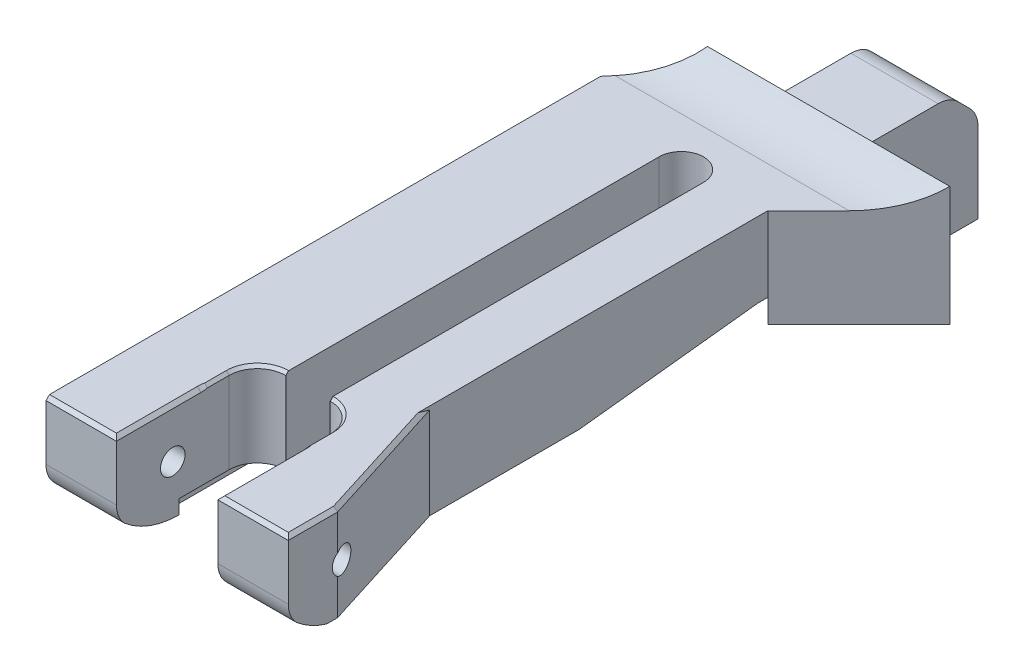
ISO-10303-21;
HEADER;
FILE_DESCRIPTION(('STEP AP214'),'2;1');
FILE_NAME('part.step','',(''),(''),'','','');
FILE_SCHEMA(('AUTOMOTIVE_DESIGN { 1 0 10303 214 1 1 1 1 }'));
ENDSEC;
DATA;
#1=APPLICATION_CONTEXT('core data for automotive mechanical design processes');
#2=APPLICATION_PROTOCOL_DEFINITION('international standard','automotive_design',2000,#1);
#3=PRODUCT_CONTEXT('',#1,'mechanical');
#4=PRODUCT('Part','Part','',(#3));
#5=PRODUCT_RELATED_PRODUCT_CATEGORY('part','',(#4));
#6=PRODUCT_DEFINITION_FORMATION('','',#4);
#7=PRODUCT_DEFINITION_CONTEXT('part definition',#1,'design');
#8=PRODUCT_DEFINITION('design','',#6,#7);
#9=PRODUCT_DEFINITION_SHAPE('','',#8);
#10=(LENGTH_UNIT() NAMED_UNIT(*) SI_UNIT(.MILLI.,.METRE.));
#11=(NAMED_UNIT(*) PLANE_ANGLE_UNIT() SI_UNIT($,.RADIAN.));
#12=(NAMED_UNIT(*) SI_UNIT($,.STERADIAN.) SOLID_ANGLE_UNIT());
#13=UNCERTAINTY_MEASURE_WITH_UNIT(LENGTH_MEASURE(1.E-05),#10,'distance_accuracy_value','');
#14=(GEOMETRIC_REPRESENTATION_CONTEXT(3) GLOBAL_UNCERTAINTY_ASSIGNED_CONTEXT((#13)) GLOBAL_UNIT_ASSIGNED_CONTEXT((#10,
#11,#12)) REPRESENTATION_CONTEXT('',''));
#15=CARTESIAN_POINT('',(0.,0.,0.));
#16=DIRECTION('',(0.,0.,1.));
#17=DIRECTION('',(1.,0.,0.));
#18=AXIS2_PLACEMENT_3D('',#15,#16,#17);
#19=CARTESIAN_POINT('',(-4.3,0.998405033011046,16.));
#20=DIRECTION('',(0.,-1.,0.));
#21=DIRECTION('',(0.,0.,-1.));
#22=AXIS2_PLACEMENT_3D('',#19,#20,#21);
#23=PLANE('',#22);
#24=DIRECTION('',(1.,0.,0.));
#25=VECTOR('',#24,1.);
#26=CARTESIAN_POINT('',(-1.59999999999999,0.998405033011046,15.));
#27=LINE('',#26,#25);
#28=CARTESIAN_POINT('',(1.575,0.998405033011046,15.));
#29=VERTEX_POINT('',#28);
#30=CARTESIAN_POINT('',(1.59999999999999,0.998405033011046,15.));
#31=VERTEX_POINT('',#30);
#32=EDGE_CURVE('E497',#29,#31,#27,.T.);
#33=ORIENTED_EDGE('',*,*,#32,.F.);
#34=DIRECTION('',(0.,0.,-1.));
#35=VECTOR('',#34,1.);
#36=CARTESIAN_POINT('',(1.575,0.998405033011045,10.));
#37=LINE('',#36,#35);
#38=CARTESIAN_POINT('',(1.575,0.998405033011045,2.75000000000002));
#39=VERTEX_POINT('',#38);
#40=EDGE_CURVE('E486',#29,#39,#37,.T.);
#41=ORIENTED_EDGE('',*,*,#40,.T.);
#42=DIRECTION('',(1.,0.,0.));
#43=VECTOR('',#42,1.);
#44=CARTESIAN_POINT('',(-4.3,0.998405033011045,2.75000000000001));
#45=LINE('',#44,#43);
#46=CARTESIAN_POINT('',(4.3,0.998405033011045,2.75000000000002));
#47=VERTEX_POINT('',#46);
#48=EDGE_CURVE('E687',#39,#47,#45,.T.);
#49=ORIENTED_EDGE('',*,*,#48,.T.);
#50=DIRECTION('',(0.,0.,-1.));
#51=VECTOR('',#50,1.);
#52=CARTESIAN_POINT('',(4.3,0.998405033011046,16.));
#53=LINE('',#52,#51);
#54=CARTESIAN_POINT('',(4.3,0.998405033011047,20.5450324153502));
#55=VERTEX_POINT('',#54);
#56=EDGE_CURVE('E672',#55,#47,#53,.T.);
#57=ORIENTED_EDGE('',*,*,#56,.F.);
#58=DIRECTION('',(-1.,0.,0.));
#59=VECTOR('',#58,1.);
#60=CARTESIAN_POINT('',(4.3,0.998405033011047,20.5450324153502));
#61=LINE('',#60,#59);
#62=CARTESIAN_POINT('',(3.6,0.998405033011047,20.5450324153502));
#63=VERTEX_POINT('',#62);
#64=EDGE_CURVE('E1097',#55,#63,#61,.T.);
#65=ORIENTED_EDGE('',*,*,#64,.T.);
#66=DIRECTION('',(0.,0.,-1.));
#67=VECTOR('',#66,1.);
#68=CARTESIAN_POINT('',(3.6,0.998405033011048,25.));
#69=LINE('',#68,#67);
#70=CARTESIAN_POINT('',(3.6,0.998405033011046,17.));
#71=VERTEX_POINT('',#70);
#72=EDGE_CURVE('E1103',#63,#71,#69,.T.);
#73=ORIENTED_EDGE('',*,*,#72,.T.);
#74=CARTESIAN_POINT('',(1.6,0.998405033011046,17.));
#75=DIRECTION('',(0.,-1.,0.));
#76=DIRECTION('',(0.,0.,1.));
#77=AXIS2_PLACEMENT_3D('',#74,#75,#76);
#78=CIRCLE('',#77,2.);
#79=EDGE_CURVE('E1251',#31,#71,#78,.T.);
#80=ORIENTED_EDGE('',*,*,#79,.F.);
#81=EDGE_LOOP('',(#33,#41,#49,#57,#65,#73,#80));
#82=FACE_BOUND('',#81,.T.);
#83=ADVANCED_FACE('F32',(#82),#23,.T.);
#84=CARTESIAN_POINT('',(-1.59999999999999,10.998405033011,15.));
#85=DIRECTION('',(0.,0.,-1.));
#86=DIRECTION('',(0.,1.,0.));
#87=AXIS2_PLACEMENT_3D('',#84,#85,#86);
#88=PLANE('',#87);
#89=DIRECTION('',(0.,-1.,0.));
#90=VECTOR('',#89,1.);
#91=CARTESIAN_POINT('',(1.59999999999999,10.998405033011,15.));
#92=LINE('',#91,#90);
#93=CARTESIAN_POINT('',(1.59999999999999,6.8,15.));
#94=VERTEX_POINT('',#93);
#95=EDGE_CURVE('E496',#94,#31,#92,.T.);
#96=ORIENTED_EDGE('',*,*,#95,.F.);
#97=DIRECTION('',(-1.,0.,0.));
#98=VECTOR('',#97,1.);
#99=CARTESIAN_POINT('',(-1.59999999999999,6.8,15.));
#100=LINE('',#99,#98);
#101=CARTESIAN_POINT('',(1.575,6.8,15.));
#102=VERTEX_POINT('',#101);
#103=EDGE_CURVE('E1289',#94,#102,#100,.T.);
#104=ORIENTED_EDGE('',*,*,#103,.T.);
#105=DIRECTION('',(0.,-1.,0.));
#106=VECTOR('',#105,1.);
#107=CARTESIAN_POINT('',(1.575,10.998405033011,15.));
#108=LINE('',#107,#106);
#109=EDGE_CURVE('E490',#102,#29,#108,.T.);
#110=ORIENTED_EDGE('',*,*,#109,.T.);
#111=ORIENTED_EDGE('',*,*,#32,.T.);
#112=EDGE_LOOP('',(#96,#104,#110,#111));
#113=FACE_BOUND('',#112,.T.);
#114=ADVANCED_FACE('F593',(#113),#88,.F.);
#115=CARTESIAN_POINT('',(-4.3,3.53755509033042,-12.1598306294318));
#116=DIRECTION('',(0.,-1.,0.));
#117=DIRECTION('',(0.,0.,-1.));
#118=AXIS2_PLACEMENT_3D('',#115,#116,#117);
#119=PLANE('',#118);
#120=CARTESIAN_POINT('',(0.,3.53755509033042,-11.5));
#121=DIRECTION('',(0.,-1.,0.));
#122=DIRECTION('',(0.,0.,-1.));
#123=AXIS2_PLACEMENT_3D('',#120,#121,#122);
#124=CIRCLE('',#123,2.);
#125=CARTESIAN_POINT('',(2.,3.53755509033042,-11.5));
#126=VERTEX_POINT('',#125);
#127=CARTESIAN_POINT('',(1.88802106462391,3.53755509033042,-12.1598306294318));
#128=VERTEX_POINT('',#127);
#129=EDGE_CURVE('E1128',#126,#128,#124,.F.);
#130=ORIENTED_EDGE('',*,*,#129,.F.);
#131=DIRECTION('',(1.,0.,0.));
#132=VECTOR('',#131,1.);
#133=CARTESIAN_POINT('',(1.575,3.53755509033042,-11.5));
#134=LINE('',#133,#132);
#135=CARTESIAN_POINT('',(1.575,3.53755509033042,-11.5));
#136=VERTEX_POINT('',#135);
#137=EDGE_CURVE('E2143',#136,#126,#134,.T.);
#138=ORIENTED_EDGE('',*,*,#137,.F.);
#139=CARTESIAN_POINT('',(0.,3.53755509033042,-11.5));
#140=DIRECTION('',(0.,-1.,0.));
#141=DIRECTION('',(0.,0.,-1.));
#142=AXIS2_PLACEMENT_3D('',#139,#140,#141);
#143=CIRCLE('',#142,1.575);
#144=CARTESIAN_POINT('',(-1.575,3.53755509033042,-11.5));
#145=VERTEX_POINT('',#144);
#146=EDGE_CURVE('E1124',#136,#145,#143,.F.);
#147=ORIENTED_EDGE('',*,*,#146,.T.);
#148=DIRECTION('',(1.,0.,0.));
#149=VECTOR('',#148,1.);
#150=CARTESIAN_POINT('',(-2.,3.53755509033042,-11.5));
#151=LINE('',#150,#149);
#152=CARTESIAN_POINT('',(-2.,3.53755509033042,-11.5));
#153=VERTEX_POINT('',#152);
#154=EDGE_CURVE('E1093',#153,#145,#151,.T.);
#155=ORIENTED_EDGE('',*,*,#154,.F.);
#156=CARTESIAN_POINT('',(-1.88802106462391,3.53755509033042,-12.1598306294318));
#157=VERTEX_POINT('',#156);
#158=EDGE_CURVE('E1078',#157,#153,#124,.F.);
#159=ORIENTED_EDGE('',*,*,#158,.F.);
#160=DIRECTION('',(1.,0.,0.));
#161=VECTOR('',#160,1.);
#162=CARTESIAN_POINT('',(-4.3,3.53755509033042,-12.1598306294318));
#163=LINE('',#162,#161);
#164=CARTESIAN_POINT('',(-4.24907325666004,3.53755509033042,-12.1598306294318));
#165=VERTEX_POINT('',#164);
#166=EDGE_CURVE('E684',#165,#157,#163,.T.);
#167=ORIENTED_EDGE('',*,*,#166,.F.);
#168=CARTESIAN_POINT('',(0.,3.53755509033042,-11.5));
#169=DIRECTION('',(0.,1.,0.));
#170=DIRECTION('',(0.,0.,-1.));
#171=AXIS2_PLACEMENT_3D('',#168,#169,#170);
#172=CIRCLE('',#171,4.3);
#173=CARTESIAN_POINT('',(4.24907325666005,3.53755509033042,-12.1598306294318));
#174=VERTEX_POINT('',#173);
#175=EDGE_CURVE('E1018',#174,#165,#172,.T.);
#176=ORIENTED_EDGE('',*,*,#175,.F.);
#177=EDGE_CURVE('E683',#128,#174,#163,.T.);
#178=ORIENTED_EDGE('',*,*,#177,.F.);
#179=EDGE_LOOP('',(#130,#138,#147,#155,#159,#167,#176,#178));
#180=FACE_BOUND('',#179,.T.);
#181=ADVANCED_FACE('F601',(#180),#119,.T.);
#182=CARTESIAN_POINT('',(0.,0.,0.));
#183=DIRECTION('',(0.,-1.,0.));
#184=DIRECTION('',(0.,0.,-1.));
#185=AXIS2_PLACEMENT_3D('',#182,#183,#184);
#186=PLANE('',#185);
#187=DIRECTION('',(-1.,0.,0.));
#188=VECTOR('',#187,1.);
#189=CARTESIAN_POINT('',(3.6,0.,20.5450324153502));
#190=LINE('',#189,#188);
#191=CARTESIAN_POINT('',(8.03760537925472,0.,20.5450324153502));
#192=VERTEX_POINT('',#191);
#193=CARTESIAN_POINT('',(4.3,0.,20.5450324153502));
#194=VERTEX_POINT('',#193);
#195=EDGE_CURVE('E877',#192,#194,#190,.T.);
#196=ORIENTED_EDGE('',*,*,#195,.T.);
#197=DIRECTION('',(0.,0.,1.));
#198=VECTOR('',#197,1.);
#199=CARTESIAN_POINT('',(4.3,0.,-15.9));
#200=LINE('',#199,#198);
#201=CARTESIAN_POINT('',(4.3,0.,1.34025337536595));
#202=VERTEX_POINT('',#201);
#203=EDGE_CURVE('E1056',#202,#194,#200,.T.);
#204=ORIENTED_EDGE('',*,*,#203,.F.);
#205=DIRECTION('',(-1.,0.,0.));
#206=VECTOR('',#205,1.);
#207=CARTESIAN_POINT('',(10.,0.,1.34025337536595));
#208=LINE('',#207,#206);
#209=CARTESIAN_POINT('',(5.35,0.,1.34025337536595));
#210=VERTEX_POINT('',#209);
#211=EDGE_CURVE('E1037',#210,#202,#208,.T.);
#212=ORIENTED_EDGE('',*,*,#211,.F.);
#213=DIRECTION('',(0.,0.,1.));
#214=VECTOR('',#213,1.);
#215=CARTESIAN_POINT('',(5.35,0.,11.9606079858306));
#216=LINE('',#215,#214);
#217=CARTESIAN_POINT('',(5.35,0.,11.9989919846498));
#218=VERTEX_POINT('',#217);
#219=EDGE_CURVE('E757',#210,#218,#216,.T.);
#220=ORIENTED_EDGE('',*,*,#219,.T.);
#221=DIRECTION('',(0.3,0.,0.953939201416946));
#222=VECTOR('',#221,1.);
#223=CARTESIAN_POINT('',(8.36151519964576,0.,21.575));
#224=LINE('',#223,#222);
#225=EDGE_CURVE('E754',#218,#192,#224,.T.);
#226=ORIENTED_EDGE('',*,*,#225,.T.);
#227=EDGE_LOOP('',(#196,#204,#212,#220,#226));
#228=FACE_BOUND('',#227,.T.);
#229=ADVANCED_FACE('F1224',(#228),#186,.T.);
#230=DIRECTION('',(0.,0.,1.));
#231=VECTOR('',#230,1.);
#232=CARTESIAN_POINT('',(-4.3,0.,-15.9));
#233=LINE('',#232,#231);
#234=CARTESIAN_POINT('',(-4.3,0.,1.34025337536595));
#235=VERTEX_POINT('',#234);
#236=CARTESIAN_POINT('',(-4.3,0.,20.5450324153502));
#237=VERTEX_POINT('',#236);
#238=EDGE_CURVE('E666',#235,#237,#233,.T.);
#239=ORIENTED_EDGE('',*,*,#238,.T.);
#240=DIRECTION('',(-1.,0.,0.));
#241=VECTOR('',#240,1.);
#242=CARTESIAN_POINT('',(-8.35,0.,20.5450324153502));
#243=LINE('',#242,#241);
#244=CARTESIAN_POINT('',(-8.35,0.,20.5450324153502));
#245=VERTEX_POINT('',#244);
#246=EDGE_CURVE('E873',#237,#245,#243,.T.);
#247=ORIENTED_EDGE('',*,*,#246,.T.);
#248=DIRECTION('',(0.,0.,-1.));
#249=VECTOR('',#248,1.);
#250=CARTESIAN_POINT('',(-8.35,0.,1.34025337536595));
#251=LINE('',#250,#249);
#252=CARTESIAN_POINT('',(-8.35,0.,1.34025337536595));
#253=VERTEX_POINT('',#252);
#254=EDGE_CURVE('E759',#245,#253,#251,.T.);
#255=ORIENTED_EDGE('',*,*,#254,.T.);
#256=EDGE_CURVE('E1034',#235,#253,#208,.T.);
#257=ORIENTED_EDGE('',*,*,#256,.F.);
#258=EDGE_LOOP('',(#239,#247,#255,#257));
#259=FACE_BOUND('',#258,.T.);
#260=ADVANCED_FACE('F1363',(#259),#186,.T.);
#261=CARTESIAN_POINT('',(-3.6,7.,25.));
#262=DIRECTION('',(-1.,0.,0.));
#263=DIRECTION('',(0.,0.,1.));
#264=AXIS2_PLACEMENT_3D('',#261,#262,#263);
#265=PLANE('',#264);
#266=CARTESIAN_POINT('',(-3.6,3.5,21.));
#267=DIRECTION('',(-1.,0.,0.));
#268=DIRECTION('',(0.,0.,1.));
#269=AXIS2_PLACEMENT_3D('',#266,#267,#268);
#270=CIRCLE('',#269,0.875000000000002);
#271=CARTESIAN_POINT('',(-3.6,3.5,20.125));
#272=VERTEX_POINT('',#271);
#273=EDGE_CURVE('E708',#272,#272,#270,.T.);
#274=ORIENTED_EDGE('',*,*,#273,.T.);
#275=EDGE_LOOP('',(#274));
#276=FACE_BOUND('',#275,.T.);
#277=DIRECTION('',(0.,-1.,0.));
#278=VECTOR('',#277,1.);
#279=CARTESIAN_POINT('',(-3.6,10.998405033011,17.));
#280=LINE('',#279,#278);
#281=CARTESIAN_POINT('',(-3.6,6.8,17.));
#282=VERTEX_POINT('',#281);
#283=CARTESIAN_POINT('',(-3.6,0.998405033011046,17.));
#284=VERTEX_POINT('',#283);
#285=EDGE_CURVE('E508',#282,#284,#280,.T.);
#286=ORIENTED_EDGE('',*,*,#285,.F.);
#287=DIRECTION('',(0.,0.,1.));
#288=VECTOR('',#287,1.);
#289=CARTESIAN_POINT('',(-3.6,6.8,25.));
#290=LINE('',#289,#288);
#291=CARTESIAN_POINT('',(-3.6,6.79999999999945,18.5500000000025));
#292=VERTEX_POINT('',#291);
#293=EDGE_CURVE('E566',#282,#292,#290,.T.);
#294=ORIENTED_EDGE('',*,*,#293,.T.);
#295=CARTESIAN_POINT('',(-3.6,8.50620829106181,15.8205187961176));
#296=CARTESIAN_POINT('',(-3.6,8.44267597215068,15.8955900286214));
#297=CARTESIAN_POINT('',(-3.6,8.37949951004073,15.9709661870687));
#298=CARTESIAN_POINT('',(-3.6,8.25404018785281,16.1224790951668));
#299=CARTESIAN_POINT('',(-3.6,8.19175747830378,16.1986159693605));
#300=CARTESIAN_POINT('',(-3.6,8.06785524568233,16.3523139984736));
#301=CARTESIAN_POINT('',(-3.6,8.00624345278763,16.4298814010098));
#302=CARTESIAN_POINT('',(-3.6,7.88441225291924,16.5860960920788));
#303=CARTESIAN_POINT('',(-3.6,7.82419275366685,16.6647433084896));
#304=CARTESIAN_POINT('',(-3.6,7.6992610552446,16.831699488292));
#305=CARTESIAN_POINT('',(-3.6,7.63474288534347,16.9201542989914));
#306=CARTESIAN_POINT('',(-3.6,7.50854074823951,17.0990605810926));
#307=CARTESIAN_POINT('',(-3.6,7.44685646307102,17.1895118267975));
#308=CARTESIAN_POINT('',(-3.6,7.3274726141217,17.3726767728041));
#309=CARTESIAN_POINT('',(-3.6,7.26976271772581,17.4653836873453));
#310=CARTESIAN_POINT('',(-3.6,7.15961677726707,17.6538556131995));
#311=CARTESIAN_POINT('',(-3.6,7.10717774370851,17.7496188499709));
#312=CARTESIAN_POINT('',(-3.6,7.018479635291,17.9272488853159));
#313=CARTESIAN_POINT('',(-3.6,6.98100854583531,18.0085040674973));
#314=CARTESIAN_POINT('',(-3.6,6.91262747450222,18.1737947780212));
#315=CARTESIAN_POINT('',(-3.6,6.88171834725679,18.2578306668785));
#316=CARTESIAN_POINT('',(-3.6,6.82911399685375,18.4264513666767));
#317=CARTESIAN_POINT('',(-3.6,6.80720449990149,18.5109679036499));
#318=CARTESIAN_POINT('',(-3.6,6.77340002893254,18.681979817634));
#319=CARTESIAN_POINT('',(-3.6,6.76149640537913,18.7684734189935));
#320=CARTESIAN_POINT('',(-3.6,6.75073187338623,18.9175706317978));
#321=CARTESIAN_POINT('',(-3.6,6.74912725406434,18.9799840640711));
#322=CARTESIAN_POINT('',(-3.6,6.75176877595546,19.1046861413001));
#323=CARTESIAN_POINT('',(-3.6,6.75601452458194,19.1669747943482));
#324=CARTESIAN_POINT('',(-3.6,6.77020744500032,19.2917890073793));
#325=CARTESIAN_POINT('',(-3.6,6.78023512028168,19.3543052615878));
#326=CARTESIAN_POINT('',(-3.6,6.80549169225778,19.4782592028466));
#327=CARTESIAN_POINT('',(-3.6,6.82072070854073,19.539696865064));
#328=CARTESIAN_POINT('',(-3.6,6.86528575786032,19.694675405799));
#329=CARTESIAN_POINT('',(-3.6,6.89777533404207,19.7873078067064));
#330=CARTESIAN_POINT('',(-3.6,6.97096769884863,19.9693696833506));
#331=CARTESIAN_POINT('',(-3.6,7.01168591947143,20.0587927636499));
#332=CARTESIAN_POINT('',(-3.6,7.09804331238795,20.2324094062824));
#333=CARTESIAN_POINT('',(-3.6,7.14353378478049,20.3166778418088));
#334=CARTESIAN_POINT('',(-3.6,7.21484129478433,20.4410358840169));
#335=CARTESIAN_POINT('',(-3.6,7.23906336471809,20.4820560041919));
#336=CARTESIAN_POINT('',(-3.6,7.28842029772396,20.5635296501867));
#337=CARTESIAN_POINT('',(-3.6,7.31355492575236,20.6039833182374));
#338=CARTESIAN_POINT('',(-3.6,7.33908324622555,20.6441873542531));
#339=B_SPLINE_CURVE_WITH_KNOTS('',3,(#295,#296,#297,#298,#299,#300,#301,#302,#303,#304,#305,
#306,#307,#308,#309,#310,#311,#312,#313,#314,#315,#316,#317,#318,#319,#320,#321,#322,#323,#324,
#325,#326,#327,#328,#329,#330,#331,#332,#333,#334,#335,#336,#337,#338),.UNSPECIFIED.,.F.,.F.,(4,
2,2,2,2,2,2,2,2,2,2,2,2,2,2,2,2,2,2,2,2,4),(0.,0.295042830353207,0.590134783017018,
0.887299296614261,1.18444405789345,1.51285606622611,1.8412311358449,2.16871747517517,
2.49601701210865,2.7642400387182,3.03249797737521,3.2939357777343,3.55514734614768,
3.74218819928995,3.92921650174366,4.11891399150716,4.30861584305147,4.60254856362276,
4.89703772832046,5.18415504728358,5.32705943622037,5.46992727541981),.UNSPECIFIED.);
#340=CARTESIAN_POINT('',(-3.6,6.74999999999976,19.));
#341=VERTEX_POINT('',#340);
#342=EDGE_CURVE('E491',#292,#341,#339,.T.);
#343=ORIENTED_EDGE('',*,*,#342,.T.);
#344=DIRECTION('',(0.,0.,1.));
#345=VECTOR('',#344,1.);
#346=CARTESIAN_POINT('',(-3.6,6.75,25.));
#347=LINE('',#346,#345);
#348=CARTESIAN_POINT('',(-3.6,6.75,25.));
#349=VERTEX_POINT('',#348);
#350=EDGE_CURVE('E787',#341,#349,#347,.T.);
#351=ORIENTED_EDGE('',*,*,#350,.T.);
#352=DIRECTION('',(0.,-1.,0.));
#353=VECTOR('',#352,1.);
#354=CARTESIAN_POINT('',(-3.6,7.,25.));
#355=LINE('',#354,#353);
#356=CARTESIAN_POINT('',(-3.6,2.8284271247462,25.));
#357=VERTEX_POINT('',#356);
#358=EDGE_CURVE('E725',#349,#357,#355,.T.);
#359=ORIENTED_EDGE('',*,*,#358,.T.);
#360=CARTESIAN_POINT('',(-3.6,2.8284271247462,23.));
#361=DIRECTION('',(-1.,0.,0.));
#362=DIRECTION('',(0.,0.,1.));
#363=AXIS2_PLACEMENT_3D('',#360,#361,#362);
#364=CIRCLE('',#363,2.);
#365=CARTESIAN_POINT('',(-3.6,1.4142135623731,24.4142135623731));
#366=VERTEX_POINT('',#365);
#367=EDGE_CURVE('E866',#357,#366,#364,.F.);
#368=ORIENTED_EDGE('',*,*,#367,.T.);
#369=CARTESIAN_POINT('',(-3.6,6.,20.5450324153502));
#370=DIRECTION('',(-1.,0.,0.));
#371=DIRECTION('',(0.,0.,1.));
#372=AXIS2_PLACEMENT_3D('',#369,#370,#371);
#373=CIRCLE('',#372,6.);
#374=CARTESIAN_POINT('',(-3.6,0.,20.5450324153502));
#375=VERTEX_POINT('',#374);
#376=EDGE_CURVE('E892',#366,#375,#373,.F.);
#377=ORIENTED_EDGE('',*,*,#376,.T.);
#378=DIRECTION('',(0.,-1.,0.));
#379=VECTOR('',#378,1.);
#380=CARTESIAN_POINT('',(-3.6,7.,20.5450324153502));
#381=LINE('',#380,#379);
#382=CARTESIAN_POINT('',(-3.6,0.998405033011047,20.5450324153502));
#383=VERTEX_POINT('',#382);
#384=EDGE_CURVE('E1113',#383,#375,#381,.T.);
#385=ORIENTED_EDGE('',*,*,#384,.F.);
#386=DIRECTION('',(0.,0.,1.));
#387=VECTOR('',#386,1.);
#388=CARTESIAN_POINT('',(-3.6,0.998405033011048,25.));
#389=LINE('',#388,#387);
#390=EDGE_CURVE('E1109',#284,#383,#389,.T.);
#391=ORIENTED_EDGE('',*,*,#390,.F.);
#392=EDGE_LOOP('',(#286,#294,#343,#351,#359,#368,#377,#385,#391));
#393=FACE_BOUND('',#392,.T.);
#394=ADVANCED_FACE('F1360',(#276,#393),#265,.F.);
#395=CARTESIAN_POINT('',(3.6,7.,25.));
#396=DIRECTION('',(1.,0.,0.));
#397=DIRECTION('',(0.,0.,-1.));
#398=AXIS2_PLACEMENT_3D('',#395,#396,#397);
#399=PLANE('',#398);
#400=CARTESIAN_POINT('',(3.6,3.5,21.));
#401=DIRECTION('',(1.,0.,0.));
#402=DIRECTION('',(0.,0.,-1.));
#403=AXIS2_PLACEMENT_3D('',#400,#401,#402);
#404=CIRCLE('',#403,0.875000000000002);
#405=CARTESIAN_POINT('',(3.6,3.5,20.125));
#406=VERTEX_POINT('',#405);
#407=EDGE_CURVE('E705',#406,#406,#404,.T.);
#408=ORIENTED_EDGE('',*,*,#407,.T.);
#409=EDGE_LOOP('',(#408));
#410=FACE_BOUND('',#409,.T.);
#411=CARTESIAN_POINT('',(3.6,8.50620829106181,15.8205187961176));
#412=CARTESIAN_POINT('',(3.6,8.44267597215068,15.8955900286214));
#413=CARTESIAN_POINT('',(3.6,8.37949951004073,15.9709661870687));
#414=CARTESIAN_POINT('',(3.6,8.25404018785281,16.1224790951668));
#415=CARTESIAN_POINT('',(3.6,8.19175747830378,16.1986159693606));
#416=CARTESIAN_POINT('',(3.6,8.06785524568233,16.3523139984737));
#417=CARTESIAN_POINT('',(3.6,8.00624345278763,16.4298814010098));
#418=CARTESIAN_POINT('',(3.6,7.88441225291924,16.5860960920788));
#419=CARTESIAN_POINT('',(3.6,7.82419275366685,16.6647433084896));
#420=CARTESIAN_POINT('',(3.6,7.69926105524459,16.831699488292));
#421=CARTESIAN_POINT('',(3.6,7.63474288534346,16.9201542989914));
#422=CARTESIAN_POINT('',(3.6,7.50854074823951,17.0990605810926));
#423=CARTESIAN_POINT('',(3.6,7.44685646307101,17.1895118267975));
#424=CARTESIAN_POINT('',(3.6,7.3274726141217,17.3726767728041));
#425=CARTESIAN_POINT('',(3.6,7.26976271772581,17.4653836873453));
#426=CARTESIAN_POINT('',(3.6,7.15961677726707,17.6538556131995));
#427=CARTESIAN_POINT('',(3.6,7.10717774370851,17.7496188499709));
#428=CARTESIAN_POINT('',(3.6,7.018479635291,17.9272488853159));
#429=CARTESIAN_POINT('',(3.6,6.98100854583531,18.0085040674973));
#430=CARTESIAN_POINT('',(3.6,6.91262747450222,18.1737947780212));
#431=CARTESIAN_POINT('',(3.6,6.8817183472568,18.2578306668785));
#432=CARTESIAN_POINT('',(3.6,6.82911399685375,18.4264513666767));
#433=CARTESIAN_POINT('',(3.6,6.80720449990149,18.5109679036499));
#434=CARTESIAN_POINT('',(3.6,6.77340002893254,18.681979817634));
#435=CARTESIAN_POINT('',(3.6,6.76149640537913,18.7684734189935));
#436=CARTESIAN_POINT('',(3.6,6.75073187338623,18.9175706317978));
#437=CARTESIAN_POINT('',(3.6,6.74912725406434,18.9799840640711));
#438=CARTESIAN_POINT('',(3.6,6.75176877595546,19.1046861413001));
#439=CARTESIAN_POINT('',(3.6,6.75601452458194,19.1669747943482));
#440=CARTESIAN_POINT('',(3.6,6.77020744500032,19.2917890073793));
#441=CARTESIAN_POINT('',(3.6,6.78023512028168,19.3543052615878));
#442=CARTESIAN_POINT('',(3.6,6.80549169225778,19.4782592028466));
#443=CARTESIAN_POINT('',(3.6,6.82072070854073,19.539696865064));
#444=CARTESIAN_POINT('',(3.6,6.86528575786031,19.6946754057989));
#445=CARTESIAN_POINT('',(3.6,6.89777533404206,19.7873078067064));
#446=CARTESIAN_POINT('',(3.6,6.97096769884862,19.9693696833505));
#447=CARTESIAN_POINT('',(3.6,7.01168591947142,20.0587927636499));
#448=CARTESIAN_POINT('',(3.6,7.09804331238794,20.2324094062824));
#449=CARTESIAN_POINT('',(3.6,7.14353378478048,20.3166778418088));
#450=CARTESIAN_POINT('',(3.6,7.21484129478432,20.4410358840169));
#451=CARTESIAN_POINT('',(3.6,7.23906336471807,20.4820560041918));
#452=CARTESIAN_POINT('',(3.6,7.28842029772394,20.5635296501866));
#453=CARTESIAN_POINT('',(3.6,7.31355492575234,20.6039833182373));
#454=CARTESIAN_POINT('',(3.6,7.33908324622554,20.6441873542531));
#455=B_SPLINE_CURVE_WITH_KNOTS('',3,(#411,#412,#413,#414,#415,#416,#417,#418,#419,#420,#421,
#422,#423,#424,#425,#426,#427,#428,#429,#430,#431,#432,#433,#434,#435,#436,#437,#438,#439,#440,
#441,#442,#443,#444,#445,#446,#447,#448,#449,#450,#451,#452,#453,#454),.UNSPECIFIED.,.F.,.F.,(4,
2,2,2,2,2,2,2,2,2,2,2,2,2,2,2,2,2,2,2,2,4),(0.,0.295042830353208,0.590134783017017,
0.887299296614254,1.18444405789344,1.51285606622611,1.84123113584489,2.16871747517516,
2.49601701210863,2.76424003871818,3.03249797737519,3.29393577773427,3.55514734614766,
3.74218819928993,3.92921650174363,4.11891399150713,4.30861584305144,4.60254856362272,
4.89703772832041,5.18415504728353,5.32705943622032,5.46992727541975),.UNSPECIFIED.);
#456=CARTESIAN_POINT('',(3.6,6.75,19.));
#457=VERTEX_POINT('',#456);
#458=CARTESIAN_POINT('',(3.6,6.79999999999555,18.5500000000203));
#459=VERTEX_POINT('',#458);
#460=EDGE_CURVE('E507',#457,#459,#455,.F.);
#461=ORIENTED_EDGE('',*,*,#460,.T.);
#462=DIRECTION('',(0.,0.,-1.));
#463=VECTOR('',#462,1.);
#464=CARTESIAN_POINT('',(3.6,6.8,25.));
#465=LINE('',#464,#463);
#466=CARTESIAN_POINT('',(3.6,6.8,17.));
#467=VERTEX_POINT('',#466);
#468=EDGE_CURVE('E540',#459,#467,#465,.T.);
#469=ORIENTED_EDGE('',*,*,#468,.T.);
#470=DIRECTION('',(0.,-1.,0.));
#471=VECTOR('',#470,1.);
#472=CARTESIAN_POINT('',(3.6,10.998405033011,17.));
#473=LINE('',#472,#471);
#474=EDGE_CURVE('E499',#467,#71,#473,.T.);
#475=ORIENTED_EDGE('',*,*,#474,.T.);
#476=ORIENTED_EDGE('',*,*,#72,.F.);
#477=DIRECTION('',(0.,1.,0.));
#478=VECTOR('',#477,1.);
#479=CARTESIAN_POINT('',(3.6,7.,20.5450324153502));
#480=LINE('',#479,#478);
#481=CARTESIAN_POINT('',(3.6,0.,20.5450324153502));
#482=VERTEX_POINT('',#481);
#483=EDGE_CURVE('E1111',#482,#63,#480,.T.);
#484=ORIENTED_EDGE('',*,*,#483,.F.);
#485=CARTESIAN_POINT('',(3.6,6.,20.5450324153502));
#486=DIRECTION('',(1.,0.,0.));
#487=DIRECTION('',(0.,0.,-1.));
#488=AXIS2_PLACEMENT_3D('',#485,#486,#487);
#489=CIRCLE('',#488,6.);
#490=CARTESIAN_POINT('',(3.6,1.4142135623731,24.4142135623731));
#491=VERTEX_POINT('',#490);
#492=EDGE_CURVE('E880',#482,#491,#489,.F.);
#493=ORIENTED_EDGE('',*,*,#492,.T.);
#494=CARTESIAN_POINT('',(3.6,2.8284271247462,23.));
#495=DIRECTION('',(1.,0.,0.));
#496=DIRECTION('',(0.,0.,-1.));
#497=AXIS2_PLACEMENT_3D('',#494,#495,#496);
#498=CIRCLE('',#497,2.);
#499=CARTESIAN_POINT('',(3.6,2.8284271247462,25.));
#500=VERTEX_POINT('',#499);
#501=EDGE_CURVE('E861',#491,#500,#498,.F.);
#502=ORIENTED_EDGE('',*,*,#501,.T.);
#503=DIRECTION('',(0.,-1.,0.));
#504=VECTOR('',#503,1.);
#505=CARTESIAN_POINT('',(3.6,7.,25.));
#506=LINE('',#505,#504);
#507=CARTESIAN_POINT('',(3.6,6.75,25.));
#508=VERTEX_POINT('',#507);
#509=EDGE_CURVE('E722',#508,#500,#506,.T.);
#510=ORIENTED_EDGE('',*,*,#509,.F.);
#511=DIRECTION('',(0.,0.,-1.));
#512=VECTOR('',#511,1.);
#513=CARTESIAN_POINT('',(3.6,6.75,25.));
#514=LINE('',#513,#512);
#515=EDGE_CURVE('E785',#508,#457,#514,.T.);
#516=ORIENTED_EDGE('',*,*,#515,.T.);
#517=EDGE_LOOP('',(#461,#469,#475,#476,#484,#493,#502,#510,#516));
#518=FACE_BOUND('',#517,.T.);
#519=ADVANCED_FACE('F1246',(#410,#518),#399,.F.);
#520=CARTESIAN_POINT('',(0.,0.,-11.5));
#521=DIRECTION('',(0.,1.,0.));
#522=DIRECTION('',(0.,0.,1.));
#523=AXIS2_PLACEMENT_3D('',#520,#521,#522);
#524=CYLINDRICAL_SURFACE('',#523,2.);
#525=CARTESIAN_POINT('',(0.,3.42518567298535,-11.5));
#526=DIRECTION('',(0.,-0.985806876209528,-0.16788330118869));
#527=DIRECTION('',(0.,0.16788330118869,-0.985806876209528));
#528=AXIS2_PLACEMENT_3D('',#525,#526,#527);
#529=ELLIPSE('',#528,2.02879493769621,2.);
#530=CARTESIAN_POINT('',(-2.,3.42518567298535,-11.5));
#531=VERTEX_POINT('',#530);
#532=EDGE_CURVE('E692',#157,#531,#529,.F.);
#533=ORIENTED_EDGE('',*,*,#532,.F.);
#534=ORIENTED_EDGE('',*,*,#158,.T.);
#535=DIRECTION('',(0.,1.,0.));
#536=VECTOR('',#535,1.);
#537=CARTESIAN_POINT('',(-2.,0.,-11.5));
#538=LINE('',#537,#536);
#539=EDGE_CURVE('E712',#531,#153,#538,.T.);
#540=ORIENTED_EDGE('',*,*,#539,.F.);
#541=EDGE_LOOP('',(#533,#534,#540));
#542=FACE_BOUND('',#541,.T.);
#543=ADVANCED_FACE('F642',(#542),#524,.F.);
#544=CARTESIAN_POINT('',(0.,7.,0.));
#545=DIRECTION('',(0.,-1.,0.));
#546=DIRECTION('',(0.,0.,-1.));
#547=AXIS2_PLACEMENT_3D('',#544,#545,#546);
#548=PLANE('',#547);
#549=DIRECTION('',(0.,0.,-1.));
#550=VECTOR('',#549,1.);
#551=CARTESIAN_POINT('',(1.575,7.,-11.5));
#552=LINE('',#551,#550);
#553=CARTESIAN_POINT('',(1.575,7.,14.8));
#554=VERTEX_POINT('',#553);
#555=CARTESIAN_POINT('',(1.575,7.,-11.5));
#556=VERTEX_POINT('',#555);
#557=EDGE_CURVE('E1122',#554,#556,#552,.T.);
#558=ORIENTED_EDGE('',*,*,#557,.F.);
#559=DIRECTION('',(1.,0.,0.));
#560=VECTOR('',#559,1.);
#561=CARTESIAN_POINT('',(0.,7.,14.8));
#562=LINE('',#561,#560);
#563=CARTESIAN_POINT('',(1.59999999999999,7.,14.8));
#564=VERTEX_POINT('',#563);
#565=EDGE_CURVE('E1287',#554,#564,#562,.T.);
#566=ORIENTED_EDGE('',*,*,#565,.T.);
#567=CARTESIAN_POINT('',(1.6,7.,17.));
#568=DIRECTION('',(0.,-1.,0.));
#569=DIRECTION('',(0.,0.,-1.));
#570=AXIS2_PLACEMENT_3D('',#567,#568,#569);
#571=CIRCLE('',#570,2.2);
#572=CARTESIAN_POINT('',(3.8,7.,17.));
#573=VERTEX_POINT('',#572);
#574=EDGE_CURVE('E1280',#564,#573,#571,.T.);
#575=ORIENTED_EDGE('',*,*,#574,.T.);
#576=DIRECTION('',(0.,0.,1.));
#577=VECTOR('',#576,1.);
#578=CARTESIAN_POINT('',(3.8,7.,0.));
#579=LINE('',#578,#577);
#580=CARTESIAN_POINT('',(3.8,7.,18.5283009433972));
#581=VERTEX_POINT('',#580);
#582=EDGE_CURVE('E1285',#573,#581,#579,.T.);
#583=ORIENTED_EDGE('',*,*,#582,.T.);
#584=CARTESIAN_POINT('',(1.6,7.,19.));
#585=DIRECTION('',(0.,-1.,0.));
#586=DIRECTION('',(0.,0.,-1.));
#587=AXIS2_PLACEMENT_3D('',#584,#585,#586);
#588=CIRCLE('',#587,2.25);
#589=CARTESIAN_POINT('',(3.85,7.,19.));
#590=VERTEX_POINT('',#589);
#591=EDGE_CURVE('E776',#581,#590,#588,.T.);
#592=ORIENTED_EDGE('',*,*,#591,.T.);
#593=DIRECTION('',(0.,0.,1.));
#594=VECTOR('',#593,1.);
#595=CARTESIAN_POINT('',(3.85,7.,0.));
#596=LINE('',#595,#594);
#597=CARTESIAN_POINT('',(3.85,7.,24.75));
#598=VERTEX_POINT('',#597);
#599=EDGE_CURVE('E773',#590,#598,#596,.T.);
#600=ORIENTED_EDGE('',*,*,#599,.T.);
#601=DIRECTION('',(1.,0.,0.));
#602=VECTOR('',#601,1.);
#603=CARTESIAN_POINT('',(0.,7.,24.75));
#604=LINE('',#603,#602);
#605=CARTESIAN_POINT('',(8.35,7.,24.75));
#606=VERTEX_POINT('',#605);
#607=EDGE_CURVE('E771',#598,#606,#604,.T.);
#608=ORIENTED_EDGE('',*,*,#607,.T.);
#609=DIRECTION('',(0.,0.,-1.));
#610=VECTOR('',#609,1.);
#611=CARTESIAN_POINT('',(8.35,7.,0.));
#612=LINE('',#611,#610);
#613=CARTESIAN_POINT('',(8.35,7.,21.5383839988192));
#614=VERTEX_POINT('',#613);
#615=EDGE_CURVE('E766',#606,#614,#612,.T.);
#616=ORIENTED_EDGE('',*,*,#615,.T.);
#617=DIRECTION('',(-0.3,0.,-0.953939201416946));
#618=VECTOR('',#617,1.);
#619=CARTESIAN_POINT('',(1.43460735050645,7.,-0.451163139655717));
#620=LINE('',#619,#618);
#621=CARTESIAN_POINT('',(5.6,7.,12.7939413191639));
#622=VERTEX_POINT('',#621);
#623=EDGE_CURVE('E768',#614,#622,#620,.T.);
#624=ORIENTED_EDGE('',*,*,#623,.T.);
#625=DIRECTION('',(0.,0.,1.));
#626=VECTOR('',#625,1.);
#627=CARTESIAN_POINT('',(5.6,7.,-18.5));
#628=LINE('',#627,#626);
#629=CARTESIAN_POINT('',(5.6,7.,-12.04));
#630=VERTEX_POINT('',#629);
#631=EDGE_CURVE('E693',#630,#622,#628,.T.);
#632=ORIENTED_EDGE('',*,*,#631,.F.);
#633=DIRECTION('',(0.707106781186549,0.,-0.707106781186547));
#634=VECTOR('',#633,1.);
#635=CARTESIAN_POINT('',(12.0641016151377,7.,-18.5041016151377));
#636=LINE('',#635,#634);
#637=CARTESIAN_POINT('',(8.4899733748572,7.,-14.9299733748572));
#638=VERTEX_POINT('',#637);
#639=EDGE_CURVE('E1002',#630,#638,#636,.T.);
#640=ORIENTED_EDGE('',*,*,#639,.T.);
#641=DIRECTION('',(-1.,0.,0.));
#642=VECTOR('',#641,1.);
#643=CARTESIAN_POINT('',(0.,7.,-14.9299733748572));
#644=LINE('',#643,#642);
#645=CARTESIAN_POINT('',(-8.1320833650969,7.,-14.9299733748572));
#646=VERTEX_POINT('',#645);
#647=EDGE_CURVE('E901',#638,#646,#644,.T.);
#648=ORIENTED_EDGE('',*,*,#647,.T.);
#649=DIRECTION('',(0.642787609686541,0.,-0.766044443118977));
#650=VECTOR('',#649,1.);
#651=CARTESIAN_POINT('',(-12.1236791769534,7.,-10.1729747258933));
#652=LINE('',#651,#650);
#653=CARTESIAN_POINT('',(-8.6,7.,-14.3723320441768));
#654=VERTEX_POINT('',#653);
#655=EDGE_CURVE('E988',#654,#646,#652,.T.);
#656=ORIENTED_EDGE('',*,*,#655,.F.);
#657=DIRECTION('',(0.,0.,1.));
#658=VECTOR('',#657,1.);
#659=CARTESIAN_POINT('',(-8.6,7.,25.));
#660=LINE('',#659,#658);
#661=CARTESIAN_POINT('',(-8.6,7.,24.75));
#662=VERTEX_POINT('',#661);
#663=EDGE_CURVE('E715',#654,#662,#660,.T.);
#664=ORIENTED_EDGE('',*,*,#663,.T.);
#665=DIRECTION('',(1.,0.,0.));
#666=VECTOR('',#665,1.);
#667=CARTESIAN_POINT('',(0.,7.,24.75));
#668=LINE('',#667,#666);
#669=CARTESIAN_POINT('',(-3.85,7.,24.75));
#670=VERTEX_POINT('',#669);
#671=EDGE_CURVE('E783',#662,#670,#668,.T.);
#672=ORIENTED_EDGE('',*,*,#671,.T.);
#673=DIRECTION('',(0.,0.,-1.));
#674=VECTOR('',#673,1.);
#675=CARTESIAN_POINT('',(-3.85,7.,0.));
#676=LINE('',#675,#674);
#677=CARTESIAN_POINT('',(-3.85,7.,19.));
#678=VERTEX_POINT('',#677);
#679=EDGE_CURVE('E781',#670,#678,#676,.T.);
#680=ORIENTED_EDGE('',*,*,#679,.T.);
#681=CARTESIAN_POINT('',(-1.6,7.,19.));
#682=DIRECTION('',(0.,-1.,0.));
#683=DIRECTION('',(0.,0.,-1.));
#684=AXIS2_PLACEMENT_3D('',#681,#682,#683);
#685=CIRCLE('',#684,2.25);
#686=CARTESIAN_POINT('',(-3.8,7.,18.5283009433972));
#687=VERTEX_POINT('',#686);
#688=EDGE_CURVE('E778',#678,#687,#685,.T.);
#689=ORIENTED_EDGE('',*,*,#688,.T.);
#690=DIRECTION('',(0.,0.,-1.));
#691=VECTOR('',#690,1.);
#692=CARTESIAN_POINT('',(-3.8,7.,0.));
#693=LINE('',#692,#691);
#694=CARTESIAN_POINT('',(-3.8,7.,17.));
#695=VERTEX_POINT('',#694);
#696=EDGE_CURVE('E1278',#687,#695,#693,.T.);
#697=ORIENTED_EDGE('',*,*,#696,.T.);
#698=CARTESIAN_POINT('',(-1.6,7.,17.));
#699=DIRECTION('',(0.,-1.,0.));
#700=DIRECTION('',(0.,0.,-1.));
#701=AXIS2_PLACEMENT_3D('',#698,#699,#700);
#702=CIRCLE('',#701,2.2);
#703=CARTESIAN_POINT('',(-1.59999999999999,7.,14.8));
#704=VERTEX_POINT('',#703);
#705=EDGE_CURVE('E1272',#695,#704,#702,.T.);
#706=ORIENTED_EDGE('',*,*,#705,.T.);
#707=DIRECTION('',(1.,0.,0.));
#708=VECTOR('',#707,1.);
#709=CARTESIAN_POINT('',(0.,7.,14.8));
#710=LINE('',#709,#708);
#711=CARTESIAN_POINT('',(-1.575,7.,14.8));
#712=VERTEX_POINT('',#711);
#713=EDGE_CURVE('E1276',#704,#712,#710,.T.);
#714=ORIENTED_EDGE('',*,*,#713,.T.);
#715=DIRECTION('',(0.,0.,1.));
#716=VECTOR('',#715,1.);
#717=CARTESIAN_POINT('',(-1.575,7.,10.));
#718=LINE('',#717,#716);
#719=CARTESIAN_POINT('',(-1.575,7.,-11.5));
#720=VERTEX_POINT('',#719);
#721=EDGE_CURVE('E1115',#720,#712,#718,.T.);
#722=ORIENTED_EDGE('',*,*,#721,.F.);
#723=CARTESIAN_POINT('',(0.,7.,-11.5));
#724=DIRECTION('',(0.,1.,0.));
#725=DIRECTION('',(0.,0.,1.));
#726=AXIS2_PLACEMENT_3D('',#723,#724,#725);
#727=CIRCLE('',#726,1.575);
#728=EDGE_CURVE('E1119',#556,#720,#727,.T.);
#729=ORIENTED_EDGE('',*,*,#728,.F.);
#730=EDGE_LOOP('',(#558,#566,#575,#583,#592,#600,#608,#616,#624,#632,#640,#648,#656,#664,#672,
#680,#689,#697,#706,#714,#722,#729));
#731=FACE_BOUND('',#730,.T.);
#732=ADVANCED_FACE('F1191',(#731),#548,.F.);
#733=DIRECTION('',(1.,0.,0.));
#734=VECTOR('',#733,1.);
#735=CARTESIAN_POINT('',(-11.0990950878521,7.,-18.501779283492));
#736=LINE('',#735,#734);
#737=CARTESIAN_POINT('',(6.56410161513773,7.,-18.501779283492));
#738=VERTEX_POINT('',#737);
#739=CARTESIAN_POINT('',(12.061779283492,7.,-18.501779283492));
#740=VERTEX_POINT('',#739);
#741=EDGE_CURVE('E1149',#738,#740,#736,.T.);
#742=ORIENTED_EDGE('',*,*,#741,.T.);
#743=CARTESIAN_POINT('',(12.0641016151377,7.,-18.5041016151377));
#744=VERTEX_POINT('',#743);
#745=EDGE_CURVE('E1001',#740,#744,#636,.T.);
#746=ORIENTED_EDGE('',*,*,#745,.T.);
#747=DIRECTION('',(0.999999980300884,0.,-0.000198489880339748));
#748=VECTOR('',#747,1.);
#749=CARTESIAN_POINT('',(-0.00367240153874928,7.,-18.50170628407));
#750=LINE('',#749,#748);
#751=CARTESIAN_POINT('',(6.56410161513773,7.,-18.5030099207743));
#752=VERTEX_POINT('',#751);
#753=EDGE_CURVE('E998',#752,#744,#750,.T.);
#754=ORIENTED_EDGE('',*,*,#753,.F.);
#755=DIRECTION('',(0.,0.,1.));
#756=VECTOR('',#755,1.);
#757=CARTESIAN_POINT('',(6.56410161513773,7.,0.));
#758=LINE('',#757,#756);
#759=EDGE_CURVE('E958',#752,#738,#758,.T.);
#760=ORIENTED_EDGE('',*,*,#759,.T.);
#761=EDGE_LOOP('',(#742,#746,#754,#760));
#762=FACE_BOUND('',#761,.T.);
#763=ADVANCED_FACE('F1157',(#762),#548,.F.);
#764=CARTESIAN_POINT('',(6.56410161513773,0.,0.));
#765=DIRECTION('',(1.,0.,0.));
#766=DIRECTION('',(0.,0.,-1.));
#767=AXIS2_PLACEMENT_3D('',#764,#765,#766);
#768=PLANE('',#767);
#769=CARTESIAN_POINT('',(6.56410161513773,3.5,-21.5003437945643));
#770=DIRECTION('',(1.,0.,0.));
#771=DIRECTION('',(0.,0.,-1.));
#772=AXIS2_PLACEMENT_3D('',#769,#770,#771);
#773=CIRCLE('',#772,1.2);
#774=CARTESIAN_POINT('',(6.56410161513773,3.5,-22.7003437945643));
#775=VERTEX_POINT('',#774);
#776=EDGE_CURVE('E965',#775,#775,#773,.T.);
#777=ORIENTED_EDGE('',*,*,#776,.F.);
#778=EDGE_LOOP('',(#777));
#779=FACE_BOUND('',#778,.T.);
#780=DIRECTION('',(0.,-1.,0.));
#781=VECTOR('',#780,1.);
#782=CARTESIAN_POINT('',(6.56410161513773,8.5,-26.));
#783=LINE('',#782,#781);
#784=CARTESIAN_POINT('',(6.56410161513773,5.67157287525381,-26.));
#785=VERTEX_POINT('',#784);
#786=CARTESIAN_POINT('',(6.56410161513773,0.,-26.));
#787=VERTEX_POINT('',#786);
#788=EDGE_CURVE('E952',#785,#787,#783,.T.);
#789=ORIENTED_EDGE('',*,*,#788,.F.);
#790=CARTESIAN_POINT('',(6.56410161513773,5.67157287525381,-24.));
#791=DIRECTION('',(1.,0.,0.));
#792=DIRECTION('',(0.,0.,-1.));
#793=AXIS2_PLACEMENT_3D('',#790,#791,#792);
#794=CIRCLE('',#793,2.);
#795=CARTESIAN_POINT('',(6.56410161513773,7.0857864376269,-25.4142135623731));
#796=VERTEX_POINT('',#795);
#797=EDGE_CURVE('E914',#785,#796,#794,.T.);
#798=ORIENTED_EDGE('',*,*,#797,.T.);
#799=DIRECTION('',(0.,-0.707106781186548,-0.707106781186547));
#800=VECTOR('',#799,1.);
#801=CARTESIAN_POINT('',(6.56410161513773,16.25,-16.25));
#802=LINE('',#801,#800);
#803=CARTESIAN_POINT('',(6.56410161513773,7.91421356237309,-24.5857864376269));
#804=VERTEX_POINT('',#803);
#805=EDGE_CURVE('E906',#796,#804,#802,.F.);
#806=ORIENTED_EDGE('',*,*,#805,.T.);
#807=CARTESIAN_POINT('',(6.56410161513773,6.5,-23.1715728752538));
#808=DIRECTION('',(1.,0.,0.));
#809=DIRECTION('',(0.,0.,-1.));
#810=AXIS2_PLACEMENT_3D('',#807,#808,#809);
#811=CIRCLE('',#810,2.);
#812=CARTESIAN_POINT('',(6.56410161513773,8.5,-23.1715728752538));
#813=VERTEX_POINT('',#812);
#814=EDGE_CURVE('E912',#804,#813,#811,.T.);
#815=ORIENTED_EDGE('',*,*,#814,.T.);
#816=DIRECTION('',(0.,0.,-1.));
#817=VECTOR('',#816,1.);
#818=CARTESIAN_POINT('',(6.56410161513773,8.5,-18.5006875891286));
#819=LINE('',#818,#817);
#820=CARTESIAN_POINT('',(6.56410161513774,8.5,-18.5006875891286));
#821=VERTEX_POINT('',#820);
#822=EDGE_CURVE('E936',#821,#813,#819,.T.);
#823=ORIENTED_EDGE('',*,*,#822,.F.);
#824=DIRECTION('',(0.,-0.99999973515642,-0.000727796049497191));
#825=VECTOR('',#824,1.);
#826=CARTESIAN_POINT('',(6.56410161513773,0.0134692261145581,-18.5068640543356));
#827=LINE('',#826,#825);
#828=EDGE_CURVE('E945',#821,#738,#827,.T.);
#829=ORIENTED_EDGE('',*,*,#828,.T.);
#830=ORIENTED_EDGE('',*,*,#759,.F.);
#831=DIRECTION('',(0.,1.,0.));
#832=VECTOR('',#831,1.);
#833=CARTESIAN_POINT('',(6.56410161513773,0.,-18.5030099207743));
#834=LINE('',#833,#832);
#835=CARTESIAN_POINT('',(6.56410161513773,0.,-18.5030099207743));
#836=VERTEX_POINT('',#835);
#837=EDGE_CURVE('E996',#836,#752,#834,.T.);
#838=ORIENTED_EDGE('',*,*,#837,.F.);
#839=DIRECTION('',(0.,0.,-1.));
#840=VECTOR('',#839,1.);
#841=CARTESIAN_POINT('',(6.56410161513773,0.,0.));
#842=LINE('',#841,#840);
#843=EDGE_CURVE('E991',#836,#787,#842,.T.);
#844=ORIENTED_EDGE('',*,*,#843,.T.);
#845=EDGE_LOOP('',(#789,#798,#806,#815,#823,#829,#830,#838,#844));
#846=FACE_BOUND('',#845,.T.);
#847=ADVANCED_FACE('F1179',(#779,#846),#768,.T.);
#848=CARTESIAN_POINT('',(0.364101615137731,0.,0.));
#849=DIRECTION('',(-1.,0.,0.));
#850=DIRECTION('',(0.,0.,1.));
#851=AXIS2_PLACEMENT_3D('',#848,#849,#850);
#852=PLANE('',#851);
#853=CARTESIAN_POINT('',(0.364101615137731,3.5,-21.5003437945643));
#854=DIRECTION('',(-1.,0.,0.));
#855=DIRECTION('',(0.,0.,1.));
#856=AXIS2_PLACEMENT_3D('',#853,#854,#855);
#857=CIRCLE('',#856,1.2);
#858=CARTESIAN_POINT('',(0.364101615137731,3.5,-20.3003437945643));
#859=VERTEX_POINT('',#858);
#860=EDGE_CURVE('E962',#859,#859,#857,.T.);
#861=ORIENTED_EDGE('',*,*,#860,.F.);
#862=EDGE_LOOP('',(#861));
#863=FACE_BOUND('',#862,.T.);
#864=DIRECTION('',(0.,0.707106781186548,0.707106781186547));
#865=VECTOR('',#864,1.);
#866=CARTESIAN_POINT('',(0.364101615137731,16.25,-16.25));
#867=LINE('',#866,#865);
#868=CARTESIAN_POINT('',(0.364101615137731,7.91421356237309,-24.5857864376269));
#869=VERTEX_POINT('',#868);
#870=CARTESIAN_POINT('',(0.364101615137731,7.0857864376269,-25.4142135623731));
#871=VERTEX_POINT('',#870);
#872=EDGE_CURVE('E903',#869,#871,#867,.F.);
#873=ORIENTED_EDGE('',*,*,#872,.T.);
#874=CARTESIAN_POINT('',(0.364101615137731,5.67157287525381,-24.));
#875=DIRECTION('',(-1.,0.,0.));
#876=DIRECTION('',(0.,0.,1.));
#877=AXIS2_PLACEMENT_3D('',#874,#875,#876);
#878=CIRCLE('',#877,2.);
#879=CARTESIAN_POINT('',(0.364101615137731,5.67157287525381,-26.));
#880=VERTEX_POINT('',#879);
#881=EDGE_CURVE('E921',#871,#880,#878,.T.);
#882=ORIENTED_EDGE('',*,*,#881,.T.);
#883=DIRECTION('',(0.,-1.,0.));
#884=VECTOR('',#883,1.);
#885=CARTESIAN_POINT('',(0.364101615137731,8.5,-26.));
#886=LINE('',#885,#884);
#887=CARTESIAN_POINT('',(0.364101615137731,0.,-26.));
#888=VERTEX_POINT('',#887);
#889=EDGE_CURVE('E944',#880,#888,#886,.T.);
#890=ORIENTED_EDGE('',*,*,#889,.T.);
#891=DIRECTION('',(0.,0.,1.));
#892=VECTOR('',#891,1.);
#893=CARTESIAN_POINT('',(0.364101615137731,0.,0.));
#894=LINE('',#893,#892);
#895=CARTESIAN_POINT('',(0.364101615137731,0.,-18.501779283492));
#896=VERTEX_POINT('',#895);
#897=EDGE_CURVE('E973',#888,#896,#894,.T.);
#898=ORIENTED_EDGE('',*,*,#897,.T.);
#899=DIRECTION('',(0.,1.,0.));
#900=VECTOR('',#899,1.);
#901=CARTESIAN_POINT('',(0.364101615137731,0.,-18.501779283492));
#902=LINE('',#901,#900);
#903=CARTESIAN_POINT('',(0.364101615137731,7.,-18.501779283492));
#904=VERTEX_POINT('',#903);
#905=EDGE_CURVE('E979',#896,#904,#902,.T.);
#906=ORIENTED_EDGE('',*,*,#905,.T.);
#907=DIRECTION('',(0.,0.99999973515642,0.000727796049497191));
#908=VECTOR('',#907,1.);
#909=CARTESIAN_POINT('',(0.364101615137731,0.0134692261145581,-18.5068640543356));
#910=LINE('',#909,#908);
#911=CARTESIAN_POINT('',(0.364101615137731,8.5,-18.5006875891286));
#912=VERTEX_POINT('',#911);
#913=EDGE_CURVE('E943',#904,#912,#910,.T.);
#914=ORIENTED_EDGE('',*,*,#913,.T.);
#915=DIRECTION('',(0.,0.,-1.));
#916=VECTOR('',#915,1.);
#917=CARTESIAN_POINT('',(0.364101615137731,8.5,-18.5006875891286));
#918=LINE('',#917,#916);
#919=CARTESIAN_POINT('',(0.364101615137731,8.5,-23.1715728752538));
#920=VERTEX_POINT('',#919);
#921=EDGE_CURVE('E933',#912,#920,#918,.T.);
#922=ORIENTED_EDGE('',*,*,#921,.T.);
#923=CARTESIAN_POINT('',(0.364101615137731,6.5,-23.1715728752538));
#924=DIRECTION('',(-1.,0.,0.));
#925=DIRECTION('',(0.,0.,1.));
#926=AXIS2_PLACEMENT_3D('',#923,#924,#925);
#927=CIRCLE('',#926,2.);
#928=EDGE_CURVE('E920',#920,#869,#927,.T.);
#929=ORIENTED_EDGE('',*,*,#928,.T.);
#930=EDGE_LOOP('',(#873,#882,#890,#898,#906,#914,#922,#929));
#931=FACE_BOUND('',#930,.T.);
#932=ADVANCED_FACE('F940',(#863,#931),#852,.T.);
#933=DIRECTION('',(0.999999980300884,0.,-0.000198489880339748));
#934=VECTOR('',#933,1.);
#935=CARTESIAN_POINT('',(-0.00367240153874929,0.,-18.50170628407));
#936=LINE('',#935,#934);
#937=CARTESIAN_POINT('',(-5.13589838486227,0.,-18.5006875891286));
#938=VERTEX_POINT('',#937);
#939=EDGE_CURVE('E970',#938,#896,#936,.T.);
#940=ORIENTED_EDGE('',*,*,#939,.T.);
#941=ORIENTED_EDGE('',*,*,#897,.F.);
#942=DIRECTION('',(-1.,0.,0.));
#943=VECTOR('',#942,1.);
#944=CARTESIAN_POINT('',(17.8994307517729,0.,-26.));
#945=LINE('',#944,#943);
#946=EDGE_CURVE('E954',#787,#888,#945,.T.);
#947=ORIENTED_EDGE('',*,*,#946,.F.);
#948=ORIENTED_EDGE('',*,*,#843,.F.);
#949=DIRECTION('',(-0.999999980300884,0.,0.000198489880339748));
#950=VECTOR('',#949,1.);
#951=CARTESIAN_POINT('',(-0.00367240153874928,0.,-18.50170628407));
#952=LINE('',#951,#950);
#953=CARTESIAN_POINT('',(12.0641016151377,0.,-18.5041016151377));
#954=VERTEX_POINT('',#953);
#955=EDGE_CURVE('E994',#954,#836,#952,.T.);
#956=ORIENTED_EDGE('',*,*,#955,.F.);
#957=DIRECTION('',(0.707106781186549,0.,-0.707106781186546));
#958=VECTOR('',#957,1.);
#959=CARTESIAN_POINT('',(12.0641016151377,0.,-18.5041016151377));
#960=LINE('',#959,#958);
#961=CARTESIAN_POINT('',(5.6,0.,-12.04));
#962=VERTEX_POINT('',#961);
#963=EDGE_CURVE('E1008',#962,#954,#960,.T.);
#964=ORIENTED_EDGE('',*,*,#963,.F.);
#965=DIRECTION('',(0.,0.,1.));
#966=VECTOR('',#965,1.);
#967=CARTESIAN_POINT('',(5.6,0.,-18.5));
#968=LINE('',#967,#966);
#969=CARTESIAN_POINT('',(5.6,0.,-15.9));
#970=VERTEX_POINT('',#969);
#971=EDGE_CURVE('E1005',#970,#962,#968,.T.);
#972=ORIENTED_EDGE('',*,*,#971,.F.);
#973=DIRECTION('',(-1.,0.,0.));
#974=VECTOR('',#973,1.);
#975=CARTESIAN_POINT('',(10.,0.,-15.9));
#976=LINE('',#975,#974);
#977=CARTESIAN_POINT('',(4.3,0.,-15.9));
#978=VERTEX_POINT('',#977);
#979=EDGE_CURVE('E1033',#970,#978,#976,.T.);
#980=ORIENTED_EDGE('',*,*,#979,.T.);
#981=DIRECTION('',(1.,0.,0.));
#982=VECTOR('',#981,1.);
#983=CARTESIAN_POINT('',(-4.3,0.,-15.9));
#984=LINE('',#983,#982);
#985=CARTESIAN_POINT('',(-4.3,0.,-15.9));
#986=VERTEX_POINT('',#985);
#987=EDGE_CURVE('E665',#986,#978,#984,.T.);
#988=ORIENTED_EDGE('',*,*,#987,.F.);
#989=CARTESIAN_POINT('',(-7.31813438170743,0.,-15.9));
#990=VERTEX_POINT('',#989);
#991=EDGE_CURVE('E823',#986,#990,#976,.T.);
#992=ORIENTED_EDGE('',*,*,#991,.T.);
#993=DIRECTION('',(-0.64278760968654,0.,0.766044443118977));
#994=VECTOR('',#993,1.);
#995=CARTESIAN_POINT('',(-12.1236791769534,0.,-10.1729747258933));
#996=LINE('',#995,#994);
#997=EDGE_CURVE('E968',#938,#990,#996,.T.);
#998=ORIENTED_EDGE('',*,*,#997,.F.);
#999=EDGE_LOOP('',(#940,#941,#947,#948,#956,#964,#972,#980,#988,#992,#998));
#1000=FACE_BOUND('',#999,.T.);
#1001=ADVANCED_FACE('F1173',(#1000),#186,.T.);
#1002=CARTESIAN_POINT('',(-8.6,7.,25.));
#1003=DIRECTION('',(1.,0.,0.));
#1004=DIRECTION('',(0.,0.,-1.));
#1005=AXIS2_PLACEMENT_3D('',#1002,#1003,#1004);
#1006=PLANE('',#1005);
#1007=CARTESIAN_POINT('',(-8.6,3.5,21.));
#1008=DIRECTION('',(1.,0.,0.));
#1009=DIRECTION('',(0.,0.,-1.));
#1010=AXIS2_PLACEMENT_3D('',#1007,#1008,#1009);
#1011=CIRCLE('',#1010,0.875000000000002);
#1012=CARTESIAN_POINT('',(-8.6,3.5,20.125));
#1013=VERTEX_POINT('',#1012);
#1014=EDGE_CURVE('E702',#1013,#1013,#1011,.T.);
#1015=ORIENTED_EDGE('',*,*,#1014,.T.);
#1016=EDGE_LOOP('',(#1015));
#1017=FACE_BOUND('',#1016,.T.);
#1018=DIRECTION('',(0.,1.,0.));
#1019=VECTOR('',#1018,1.);
#1020=CARTESIAN_POINT('',(-8.6,0.,-14.3723320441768));
#1021=LINE('',#1020,#1019);
#1022=CARTESIAN_POINT('',(-8.6,1.67,-14.3723320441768));
#1023=VERTEX_POINT('',#1022);
#1024=EDGE_CURVE('E976',#1023,#654,#1021,.T.);
#1025=ORIENTED_EDGE('',*,*,#1024,.F.);
#1026=DIRECTION('',(0.,0.,1.));
#1027=VECTOR('',#1026,1.);
#1028=CARTESIAN_POINT('',(-8.6,1.67,-11.3203627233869));
#1029=LINE('',#1028,#1027);
#1030=CARTESIAN_POINT('',(-8.6,1.67,-11.3063866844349));
#1031=VERTEX_POINT('',#1030);
#1032=EDGE_CURVE('E745',#1023,#1031,#1029,.T.);
#1033=ORIENTED_EDGE('',*,*,#1032,.T.);
#1034=DIRECTION('',(0.,-0.111459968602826,0.99376892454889));
#1035=VECTOR('',#1034,1.);
#1036=CARTESIAN_POINT('',(-8.6,0.248442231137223,1.36811836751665));
#1037=LINE('',#1036,#1035);
#1038=CARTESIAN_POINT('',(-8.6,0.25,1.35422941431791));
#1039=VERTEX_POINT('',#1038);
#1040=EDGE_CURVE('E747',#1031,#1039,#1037,.T.);
#1041=ORIENTED_EDGE('',*,*,#1040,.T.);
#1042=DIRECTION('',(0.,0.,1.));
#1043=VECTOR('',#1042,1.);
#1044=CARTESIAN_POINT('',(-8.6,0.25,25.));
#1045=LINE('',#1044,#1043);
#1046=CARTESIAN_POINT('',(-8.6,0.25,22.2589460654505));
#1047=VERTEX_POINT('',#1046);
#1048=EDGE_CURVE('E749',#1039,#1047,#1045,.T.);
#1049=ORIENTED_EDGE('',*,*,#1048,.T.);
#1050=CARTESIAN_POINT('',(-8.6,6.,20.5450324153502));
#1051=DIRECTION('',(1.,0.,0.));
#1052=DIRECTION('',(0.,0.,-1.));
#1053=AXIS2_PLACEMENT_3D('',#1050,#1051,#1052);
#1054=CIRCLE('',#1053,6.);
#1055=CARTESIAN_POINT('',(-8.6,1.4142135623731,24.4142135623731));
#1056=VERTEX_POINT('',#1055);
#1057=EDGE_CURVE('E890',#1047,#1056,#1054,.F.);
#1058=ORIENTED_EDGE('',*,*,#1057,.T.);
#1059=CARTESIAN_POINT('',(-8.6,2.8284271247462,23.));
#1060=DIRECTION('',(1.,0.,0.));
#1061=DIRECTION('',(0.,0.,-1.));
#1062=AXIS2_PLACEMENT_3D('',#1059,#1060,#1061);
#1063=CIRCLE('',#1062,2.);
#1064=CARTESIAN_POINT('',(-8.6,2.8284271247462,25.));
#1065=VERTEX_POINT('',#1064);
#1066=EDGE_CURVE('E871',#1056,#1065,#1063,.F.);
#1067=ORIENTED_EDGE('',*,*,#1066,.T.);
#1068=DIRECTION('',(0.,-1.,0.));
#1069=VECTOR('',#1068,1.);
#1070=CARTESIAN_POINT('',(-8.6,7.,25.));
#1071=LINE('',#1070,#1069);
#1072=CARTESIAN_POINT('',(-8.6,6.75,25.));
#1073=VERTEX_POINT('',#1072);
#1074=EDGE_CURVE('E728',#1073,#1065,#1071,.T.);
#1075=ORIENTED_EDGE('',*,*,#1074,.F.);
#1076=DIRECTION('',(0.,-0.707106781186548,0.707106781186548));
#1077=VECTOR('',#1076,1.);
#1078=CARTESIAN_POINT('',(-8.6,7.,24.75));
#1079=LINE('',#1078,#1077);
#1080=EDGE_CURVE('E742',#1073,#662,#1079,.F.);
#1081=ORIENTED_EDGE('',*,*,#1080,.T.);
#1082=ORIENTED_EDGE('',*,*,#663,.F.);
#1083=EDGE_LOOP('',(#1025,#1033,#1041,#1049,#1058,#1067,#1075,#1081,#1082));
#1084=FACE_BOUND('',#1083,.T.);
#1085=ADVANCED_FACE('F1366',(#1017,#1084),#1006,.F.);
#1086=CARTESIAN_POINT('',(10.,1.42,-15.8703627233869));
#1087=DIRECTION('',(0.,-0.0208667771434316,0.99978226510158));
#1088=DIRECTION('',(0.,-0.99978226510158,-0.0208667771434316));
#1089=AXIS2_PLACEMENT_3D('',#1086,#1087,#1088);
#1090=PLANE('',#1089);
#1091=DIRECTION('',(-1.,0.,0.));
#1092=VECTOR('',#1091,1.);
#1093=CARTESIAN_POINT('',(10.,1.42,-15.8703627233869));
#1094=LINE('',#1093,#1092);
#1095=CARTESIAN_POINT('',(-4.3,1.42,-15.8703627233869));
#1096=VERTEX_POINT('',#1095);
#1097=CARTESIAN_POINT('',(-7.34300300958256,1.42,-15.8703627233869));
#1098=VERTEX_POINT('',#1097);
#1099=EDGE_CURVE('E1042',#1096,#1098,#1094,.T.);
#1100=ORIENTED_EDGE('',*,*,#1099,.T.);
#1101=DIRECTION('',(0.0175066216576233,-0.999629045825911,-0.0208635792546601));
#1102=VECTOR('',#1101,1.);
#1103=CARTESIAN_POINT('',(-7.33768769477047,1.11649523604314,-15.87669726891));
#1104=LINE('',#1103,#1102);
#1105=EDGE_CURVE('E985',#1098,#990,#1104,.T.);
#1106=ORIENTED_EDGE('',*,*,#1105,.T.);
#1107=ORIENTED_EDGE('',*,*,#991,.F.);
#1108=DIRECTION('',(0.,0.99978226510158,0.0208667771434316));
#1109=VECTOR('',#1108,1.);
#1110=CARTESIAN_POINT('',(-4.3,0.331709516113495,-15.8930767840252));
#1111=LINE('',#1110,#1109);
#1112=EDGE_CURVE('E1050',#986,#1096,#1111,.T.);
#1113=ORIENTED_EDGE('',*,*,#1112,.T.);
#1114=EDGE_LOOP('',(#1100,#1106,#1107,#1113));
#1115=FACE_BOUND('',#1114,.T.);
#1116=ADVANCED_FACE('F1369',(#1115),#1090,.T.);
#1117=CARTESIAN_POINT('',(10.,1.42,-11.3203627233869));
#1118=DIRECTION('',(0.,-1.,0.));
#1119=DIRECTION('',(0.,0.,-1.));
#1120=AXIS2_PLACEMENT_3D('',#1117,#1118,#1119);
#1121=PLANE('',#1120);
#1122=DIRECTION('',(0.,0.,-1.));
#1123=VECTOR('',#1122,1.);
#1124=CARTESIAN_POINT('',(-8.35,1.42,-15.8703627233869));
#1125=LINE('',#1124,#1123);
#1126=CARTESIAN_POINT('',(-8.35,1.42,-11.3203627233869));
#1127=VERTEX_POINT('',#1126);
#1128=CARTESIAN_POINT('',(-8.35,1.42,-14.6702704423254));
#1129=VERTEX_POINT('',#1128);
#1130=EDGE_CURVE('E763',#1127,#1129,#1125,.T.);
#1131=ORIENTED_EDGE('',*,*,#1130,.T.);
#1132=DIRECTION('',(0.642787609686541,0.,-0.766044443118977));
#1133=VECTOR('',#1132,1.);
#1134=CARTESIAN_POINT('',(-2.41772957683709,1.42,-21.7400750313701));
#1135=LINE('',#1134,#1133);
#1136=EDGE_CURVE('E978',#1129,#1098,#1135,.T.);
#1137=ORIENTED_EDGE('',*,*,#1136,.T.);
#1138=ORIENTED_EDGE('',*,*,#1099,.F.);
#1139=DIRECTION('',(0.,0.,-1.));
#1140=VECTOR('',#1139,1.);
#1141=CARTESIAN_POINT('',(-4.3,1.42,-15.9));
#1142=LINE('',#1141,#1140);
#1143=CARTESIAN_POINT('',(-4.3,1.42,-15.8832581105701));
#1144=VERTEX_POINT('',#1143);
#1145=EDGE_CURVE('E1020',#1096,#1144,#1142,.T.);
#1146=ORIENTED_EDGE('',*,*,#1145,.T.);
#1147=DIRECTION('',(1.,0.,0.));
#1148=VECTOR('',#1147,1.);
#1149=CARTESIAN_POINT('',(-4.3,1.42,-15.8832581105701));
#1150=LINE('',#1149,#1148);
#1151=CARTESIAN_POINT('',(4.3,1.42,-15.8832581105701));
#1152=VERTEX_POINT('',#1151);
#1153=EDGE_CURVE('E662',#1144,#1152,#1150,.T.);
#1154=ORIENTED_EDGE('',*,*,#1153,.T.);
#1155=DIRECTION('',(0.,0.,1.));
#1156=VECTOR('',#1155,1.);
#1157=CARTESIAN_POINT('',(4.3,1.42,-15.9));
#1158=LINE('',#1157,#1156);
#1159=CARTESIAN_POINT('',(4.3,1.42,-15.8703627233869));
#1160=VERTEX_POINT('',#1159);
#1161=EDGE_CURVE('E647',#1152,#1160,#1158,.T.);
#1162=ORIENTED_EDGE('',*,*,#1161,.T.);
#1163=CARTESIAN_POINT('',(5.35,1.42,-15.8703627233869));
#1164=VERTEX_POINT('',#1163);
#1165=EDGE_CURVE('E1045',#1164,#1160,#1094,.T.);
#1166=ORIENTED_EDGE('',*,*,#1165,.F.);
#1167=DIRECTION('',(0.,0.,1.));
#1168=VECTOR('',#1167,1.);
#1169=CARTESIAN_POINT('',(5.35,1.42,-11.3203627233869));
#1170=LINE('',#1169,#1168);
#1171=CARTESIAN_POINT('',(5.35,1.42,-11.3203627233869));
#1172=VERTEX_POINT('',#1171);
#1173=EDGE_CURVE('E789',#1164,#1172,#1170,.T.);
#1174=ORIENTED_EDGE('',*,*,#1173,.T.);
#1175=DIRECTION('',(-1.,0.,0.));
#1176=VECTOR('',#1175,1.);
#1177=CARTESIAN_POINT('',(10.,1.42,-11.3203627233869));
#1178=LINE('',#1177,#1176);
#1179=CARTESIAN_POINT('',(4.3,1.42,-11.3203627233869));
#1180=VERTEX_POINT('',#1179);
#1181=EDGE_CURVE('E1041',#1172,#1180,#1178,.T.);
#1182=ORIENTED_EDGE('',*,*,#1181,.T.);
#1183=DIRECTION('',(0.,0.,1.));
#1184=VECTOR('',#1183,1.);
#1185=CARTESIAN_POINT('',(4.3,1.42,0.));
#1186=LINE('',#1185,#1184);
#1187=CARTESIAN_POINT('',(4.3,1.42,-11.5));
#1188=VERTEX_POINT('',#1187);
#1189=EDGE_CURVE('E739',#1188,#1180,#1186,.T.);
#1190=ORIENTED_EDGE('',*,*,#1189,.F.);
#1191=CARTESIAN_POINT('',(0.,1.42,-11.5));
#1192=DIRECTION('',(0.,-1.,0.));
#1193=DIRECTION('',(0.,0.,-1.));
#1194=AXIS2_PLACEMENT_3D('',#1191,#1192,#1193);
#1195=CIRCLE('',#1194,4.3);
#1196=CARTESIAN_POINT('',(-4.3,1.42,-11.5));
#1197=VERTEX_POINT('',#1196);
#1198=EDGE_CURVE('E655',#1188,#1197,#1195,.F.);
#1199=ORIENTED_EDGE('',*,*,#1198,.T.);
#1200=DIRECTION('',(0.,0.,1.));
#1201=VECTOR('',#1200,1.);
#1202=CARTESIAN_POINT('',(-4.3,1.42,0.));
#1203=LINE('',#1202,#1201);
#1204=CARTESIAN_POINT('',(-4.3,1.42,-11.3203627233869));
#1205=VERTEX_POINT('',#1204);
#1206=EDGE_CURVE('E1048',#1197,#1205,#1203,.T.);
#1207=ORIENTED_EDGE('',*,*,#1206,.T.);
#1208=EDGE_CURVE('E1038',#1205,#1127,#1178,.T.);
#1209=ORIENTED_EDGE('',*,*,#1208,.T.);
#1210=EDGE_LOOP('',(#1131,#1137,#1138,#1146,#1154,#1162,#1166,#1174,#1182,#1190,#1199,#1207,#1209));
#1211=FACE_BOUND('',#1210,.T.);
#1212=ADVANCED_FACE('F1206',(#1211),#1121,.T.);
#1213=CARTESIAN_POINT('',(-8.35,1.42,-11.3203627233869));
#1214=DIRECTION('',(-0.707106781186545,-0.70710678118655,0.));
#1215=DIRECTION('',(0.,0.,1.));
#1216=AXIS2_PLACEMENT_3D('',#1213,#1214,#1215);
#1217=PLANE('',#1216);
#1218=ORIENTED_EDGE('',*,*,#1032,.F.);
#1219=DIRECTION('',(0.540716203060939,-0.540716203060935,-0.644400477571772));
#1220=VECTOR('',#1219,1.);
#1221=CARTESIAN_POINT('',(-9.51723440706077,2.58723440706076,-13.2792146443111));
#1222=LINE('',#1221,#1220);
#1223=EDGE_CURVE('E895',#1023,#1129,#1222,.T.);
#1224=ORIENTED_EDGE('',*,*,#1223,.T.);
#1225=ORIENTED_EDGE('',*,*,#1130,.F.);
#1226=DIRECTION('',(-0.706554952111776,0.706554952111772,0.0394993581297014));
#1227=VECTOR('',#1226,1.);
#1228=CARTESIAN_POINT('',(-7.99444612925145,1.06444612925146,-11.3402396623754));
#1229=LINE('',#1228,#1227);
#1230=EDGE_CURVE('E819',#1031,#1127,#1229,.F.);
#1231=ORIENTED_EDGE('',*,*,#1230,.F.);
#1232=EDGE_LOOP('',(#1218,#1224,#1225,#1231));
#1233=FACE_BOUND('',#1232,.T.);
#1234=ADVANCED_FACE('F627',(#1233),#1217,.T.);
#1235=CARTESIAN_POINT('',(-4.3,0.,0.));
#1236=DIRECTION('',(-1.,0.,0.));
#1237=DIRECTION('',(0.,0.,1.));
#1238=AXIS2_PLACEMENT_3D('',#1235,#1236,#1237);
#1239=PLANE('',#1238);
#1240=DIRECTION('',(0.,1.,0.));
#1241=VECTOR('',#1240,1.);
#1242=CARTESIAN_POINT('',(-4.3,-19.7641892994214,20.5450324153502));
#1243=LINE('',#1242,#1241);
#1244=CARTESIAN_POINT('',(-4.3,0.998405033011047,20.5450324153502));
#1245=VERTEX_POINT('',#1244);
#1246=EDGE_CURVE('E1099',#237,#1245,#1243,.T.);
#1247=ORIENTED_EDGE('',*,*,#1246,.F.);
#1248=ORIENTED_EDGE('',*,*,#238,.F.);
#1249=DIRECTION('',(0.,-0.111459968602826,0.99376892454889));
#1250=VECTOR('',#1249,1.);
#1251=CARTESIAN_POINT('',(-4.3,0.148453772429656,0.01665040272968));
#1252=LINE('',#1251,#1250);
#1253=EDGE_CURVE('E1046',#1205,#235,#1252,.T.);
#1254=ORIENTED_EDGE('',*,*,#1253,.F.);
#1255=ORIENTED_EDGE('',*,*,#1206,.F.);
#1256=DIRECTION('',(0.,1.,0.));
#1257=VECTOR('',#1256,1.);
#1258=CARTESIAN_POINT('',(-4.3,-8.24022774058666,-11.5));
#1259=LINE('',#1258,#1257);
#1260=CARTESIAN_POINT('',(-4.3,3.42518567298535,-11.5));
#1261=VERTEX_POINT('',#1260);
#1262=EDGE_CURVE('E656',#1197,#1261,#1259,.T.);
#1263=ORIENTED_EDGE('',*,*,#1262,.T.);
#1264=DIRECTION('',(0.,0.16788330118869,-0.985806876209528));
#1265=VECTOR('',#1264,1.);
#1266=CARTESIAN_POINT('',(-4.3,0.998405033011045,2.75000000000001));
#1267=LINE('',#1266,#1265);
#1268=CARTESIAN_POINT('',(-4.3,0.998405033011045,2.75000000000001));
#1269=VERTEX_POINT('',#1268);
#1270=EDGE_CURVE('E677',#1269,#1261,#1267,.T.);
#1271=ORIENTED_EDGE('',*,*,#1270,.F.);
#1272=DIRECTION('',(0.,0.,-1.));
#1273=VECTOR('',#1272,1.);
#1274=CARTESIAN_POINT('',(-4.3,0.998405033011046,16.));
#1275=LINE('',#1274,#1273);
#1276=EDGE_CURVE('E669',#1245,#1269,#1275,.T.);
#1277=ORIENTED_EDGE('',*,*,#1276,.F.);
#1278=EDGE_LOOP('',(#1247,#1248,#1254,#1255,#1263,#1271,#1277));
#1279=FACE_BOUND('',#1278,.T.);
#1280=ADVANCED_FACE('F620',(#1279),#1239,.F.);
#1281=CARTESIAN_POINT('',(4.3,0.,0.));
#1282=DIRECTION('',(-1.,0.,0.));
#1283=DIRECTION('',(0.,0.,1.));
#1284=AXIS2_PLACEMENT_3D('',#1281,#1282,#1283);
#1285=PLANE('',#1284);
#1286=ORIENTED_EDGE('',*,*,#56,.T.);
#1287=DIRECTION('',(0.,0.16788330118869,-0.985806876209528));
#1288=VECTOR('',#1287,1.);
#1289=CARTESIAN_POINT('',(4.3,0.998405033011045,2.75000000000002));
#1290=LINE('',#1289,#1288);
#1291=CARTESIAN_POINT('',(4.3,3.42518567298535,-11.5));
#1292=VERTEX_POINT('',#1291);
#1293=EDGE_CURVE('E667',#47,#1292,#1290,.T.);
#1294=ORIENTED_EDGE('',*,*,#1293,.T.);
#1295=DIRECTION('',(0.,1.,0.));
#1296=VECTOR('',#1295,1.);
#1297=CARTESIAN_POINT('',(4.3,-8.24022774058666,-11.5));
#1298=LINE('',#1297,#1296);
#1299=EDGE_CURVE('E1015',#1188,#1292,#1298,.T.);
#1300=ORIENTED_EDGE('',*,*,#1299,.F.);
#1301=ORIENTED_EDGE('',*,*,#1189,.T.);
#1302=DIRECTION('',(0.,-0.111459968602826,0.99376892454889));
#1303=VECTOR('',#1302,1.);
#1304=CARTESIAN_POINT('',(4.3,0.148453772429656,0.0166504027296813));
#1305=LINE('',#1304,#1303);
#1306=EDGE_CURVE('E736',#1180,#202,#1305,.T.);
#1307=ORIENTED_EDGE('',*,*,#1306,.T.);
#1308=ORIENTED_EDGE('',*,*,#203,.T.);
#1309=DIRECTION('',(0.,1.,0.));
#1310=VECTOR('',#1309,1.);
#1311=CARTESIAN_POINT('',(4.3,-19.7641892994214,20.5450324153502));
#1312=LINE('',#1311,#1310);
#1313=EDGE_CURVE('E1062',#194,#55,#1312,.T.);
#1314=ORIENTED_EDGE('',*,*,#1313,.T.);
#1315=EDGE_LOOP('',(#1286,#1294,#1300,#1301,#1307,#1308,#1314));
#1316=FACE_BOUND('',#1315,.T.);
#1317=ADVANCED_FACE('F613',(#1316),#1285,.T.);
#1318=DIRECTION('',(0.,0.,1.));
#1319=VECTOR('',#1318,1.);
#1320=CARTESIAN_POINT('',(-1.575,0.998405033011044,2.75000000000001));
#1321=LINE('',#1320,#1319);
#1322=CARTESIAN_POINT('',(-1.575,0.998405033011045,2.75000000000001));
#1323=VERTEX_POINT('',#1322);
#1324=CARTESIAN_POINT('',(-1.575,0.998405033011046,15.));
#1325=VERTEX_POINT('',#1324);
#1326=EDGE_CURVE('E477',#1323,#1325,#1321,.T.);
#1327=ORIENTED_EDGE('',*,*,#1326,.T.);
#1328=CARTESIAN_POINT('',(-1.59999999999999,0.998405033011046,15.));
#1329=VERTEX_POINT('',#1328);
#1330=EDGE_CURVE('E481',#1329,#1325,#27,.T.);
#1331=ORIENTED_EDGE('',*,*,#1330,.F.);
#1332=CARTESIAN_POINT('',(-1.6,0.998405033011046,17.));
#1333=DIRECTION('',(0.,-1.,0.));
#1334=DIRECTION('',(0.,0.,-1.));
#1335=AXIS2_PLACEMENT_3D('',#1332,#1333,#1334);
#1336=CIRCLE('',#1335,2.);
#1337=EDGE_CURVE('E502',#284,#1329,#1336,.T.);
#1338=ORIENTED_EDGE('',*,*,#1337,.F.);
#1339=ORIENTED_EDGE('',*,*,#390,.T.);
#1340=EDGE_CURVE('E1100',#383,#1245,#61,.T.);
#1341=ORIENTED_EDGE('',*,*,#1340,.T.);
#1342=ORIENTED_EDGE('',*,*,#1276,.T.);
#1343=EDGE_CURVE('E483',#1269,#1323,#45,.T.);
#1344=ORIENTED_EDGE('',*,*,#1343,.T.);
#1345=EDGE_LOOP('',(#1327,#1331,#1338,#1339,#1341,#1342,#1344));
#1346=FACE_BOUND('',#1345,.T.);
#1347=ADVANCED_FACE('F478',(#1346),#23,.T.);
#1348=CARTESIAN_POINT('',(-4.3,0.998405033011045,2.75000000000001));
#1349=DIRECTION('',(0.,-0.985806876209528,-0.16788330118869));
#1350=DIRECTION('',(0.,0.16788330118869,-0.985806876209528));
#1351=AXIS2_PLACEMENT_3D('',#1348,#1349,#1350);
#1352=PLANE('',#1351);
#1353=ORIENTED_EDGE('',*,*,#1270,.T.);
#1354=CARTESIAN_POINT('',(0.,3.42518567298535,-11.5));
#1355=DIRECTION('',(0.,-0.985806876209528,-0.16788330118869));
#1356=DIRECTION('',(0.,0.16788330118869,-0.985806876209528));
#1357=AXIS2_PLACEMENT_3D('',#1354,#1355,#1356);
#1358=ELLIPSE('',#1357,4.36190911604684,4.3);
#1359=EDGE_CURVE('E844',#1261,#165,#1358,.T.);
#1360=ORIENTED_EDGE('',*,*,#1359,.T.);
#1361=ORIENTED_EDGE('',*,*,#166,.T.);
#1362=ORIENTED_EDGE('',*,*,#532,.T.);
#1363=DIRECTION('',(1.,0.,0.));
#1364=VECTOR('',#1363,1.);
#1365=CARTESIAN_POINT('',(-1.99999999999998,3.42518567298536,-11.5));
#1366=LINE('',#1365,#1364);
#1367=CARTESIAN_POINT('',(-1.575,3.42518567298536,-11.5));
#1368=VERTEX_POINT('',#1367);
#1369=EDGE_CURVE('E1087',#531,#1368,#1366,.T.);
#1370=ORIENTED_EDGE('',*,*,#1369,.T.);
#1371=DIRECTION('',(0.,-0.16788330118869,0.985806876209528));
#1372=VECTOR('',#1371,1.);
#1373=CARTESIAN_POINT('',(-1.575,0.627899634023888,4.92559916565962));
#1374=LINE('',#1373,#1372);
#1375=EDGE_CURVE('E1090',#1368,#1323,#1374,.T.);
#1376=ORIENTED_EDGE('',*,*,#1375,.T.);
#1377=ORIENTED_EDGE('',*,*,#1343,.F.);
#1378=EDGE_LOOP('',(#1353,#1360,#1361,#1362,#1370,#1376,#1377));
#1379=FACE_BOUND('',#1378,.T.);
#1380=ADVANCED_FACE('F612',(#1379),#1352,.T.);
#1381=ORIENTED_EDGE('',*,*,#177,.T.);
#1382=CARTESIAN_POINT('',(0.,3.42518567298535,-11.5));
#1383=DIRECTION('',(0.,-0.985806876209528,-0.16788330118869));
#1384=DIRECTION('',(0.,0.16788330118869,-0.985806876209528));
#1385=AXIS2_PLACEMENT_3D('',#1382,#1383,#1384);
#1386=ELLIPSE('',#1385,4.36190911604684,4.3);
#1387=EDGE_CURVE('E1022',#174,#1292,#1386,.T.);
#1388=ORIENTED_EDGE('',*,*,#1387,.T.);
#1389=ORIENTED_EDGE('',*,*,#1293,.F.);
#1390=ORIENTED_EDGE('',*,*,#48,.F.);
#1391=DIRECTION('',(0.,0.16788330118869,-0.985806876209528));
#1392=VECTOR('',#1391,1.);
#1393=CARTESIAN_POINT('',(1.575,0.627899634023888,4.92559916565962));
#1394=LINE('',#1393,#1392);
#1395=CARTESIAN_POINT('',(1.575,3.42518567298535,-11.5));
#1396=VERTEX_POINT('',#1395);
#1397=EDGE_CURVE('E2137',#39,#1396,#1394,.T.);
#1398=ORIENTED_EDGE('',*,*,#1397,.T.);
#1399=DIRECTION('',(1.,0.,0.));
#1400=VECTOR('',#1399,1.);
#1401=CARTESIAN_POINT('',(1.57500000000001,3.42518567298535,-11.5));
#1402=LINE('',#1401,#1400);
#1403=CARTESIAN_POINT('',(2.,3.42518567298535,-11.5));
#1404=VERTEX_POINT('',#1403);
#1405=EDGE_CURVE('E2141',#1396,#1404,#1402,.T.);
#1406=ORIENTED_EDGE('',*,*,#1405,.T.);
#1407=EDGE_CURVE('E689',#1404,#128,#529,.F.);
#1408=ORIENTED_EDGE('',*,*,#1407,.T.);
#1409=EDGE_LOOP('',(#1381,#1388,#1389,#1390,#1398,#1406,#1408));
#1410=FACE_BOUND('',#1409,.T.);
#1411=ADVANCED_FACE('F618',(#1410),#1352,.T.);
#1412=CARTESIAN_POINT('',(5.6,0.,-18.5));
#1413=DIRECTION('',(-1.,0.,0.));
#1414=DIRECTION('',(0.,0.,1.));
#1415=AXIS2_PLACEMENT_3D('',#1412,#1413,#1414);
#1416=PLANE('',#1415);
#1417=DIRECTION('',(0.,0.,-1.));
#1418=VECTOR('',#1417,1.);
#1419=CARTESIAN_POINT('',(5.6,1.67,-15.8703627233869));
#1420=LINE('',#1419,#1418);
#1421=CARTESIAN_POINT('',(5.6,1.67,-11.3063866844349));
#1422=VERTEX_POINT('',#1421);
#1423=CARTESIAN_POINT('',(5.6,1.67,-12.04));
#1424=VERTEX_POINT('',#1423);
#1425=EDGE_CURVE('E797',#1422,#1424,#1420,.T.);
#1426=ORIENTED_EDGE('',*,*,#1425,.T.);
#1427=DIRECTION('',(0.,1.,0.));
#1428=VECTOR('',#1427,1.);
#1429=CARTESIAN_POINT('',(5.6,-24.1299957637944,-12.04));
#1430=LINE('',#1429,#1428);
#1431=EDGE_CURVE('E1007',#1424,#630,#1430,.T.);
#1432=ORIENTED_EDGE('',*,*,#1431,.T.);
#1433=ORIENTED_EDGE('',*,*,#631,.T.);
#1434=DIRECTION('',(0.,0.287347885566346,0.957826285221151));
#1435=VECTOR('',#1434,1.);
#1436=CARTESIAN_POINT('',(5.6,-2.1909930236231,-17.8427020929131));
#1437=LINE('',#1436,#1435);
#1438=CARTESIAN_POINT('',(5.6,6.75,11.9606079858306));
#1439=VERTEX_POINT('',#1438);
#1440=EDGE_CURVE('E814',#622,#1439,#1437,.F.);
#1441=ORIENTED_EDGE('',*,*,#1440,.T.);
#1442=DIRECTION('',(0.,1.,0.));
#1443=VECTOR('',#1442,1.);
#1444=CARTESIAN_POINT('',(5.6,0.,11.9606079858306));
#1445=LINE('',#1444,#1443);
#1446=CARTESIAN_POINT('',(5.6,0.250000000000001,11.9606079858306));
#1447=VERTEX_POINT('',#1446);
#1448=EDGE_CURVE('E695',#1447,#1439,#1445,.T.);
#1449=ORIENTED_EDGE('',*,*,#1448,.F.);
#1450=DIRECTION('',(0.,0.,-1.));
#1451=VECTOR('',#1450,1.);
#1452=CARTESIAN_POINT('',(5.6,0.25,1.34025337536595));
#1453=LINE('',#1452,#1451);
#1454=CARTESIAN_POINT('',(5.6,0.25,1.35422941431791));
#1455=VERTEX_POINT('',#1454);
#1456=EDGE_CURVE('E792',#1447,#1455,#1453,.T.);
#1457=ORIENTED_EDGE('',*,*,#1456,.T.);
#1458=DIRECTION('',(0.,0.111459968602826,-0.99376892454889));
#1459=VECTOR('',#1458,1.);
#1460=CARTESIAN_POINT('',(5.6,1.66844223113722,-11.2924977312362));
#1461=LINE('',#1460,#1459);
#1462=EDGE_CURVE('E794',#1455,#1422,#1461,.T.);
#1463=ORIENTED_EDGE('',*,*,#1462,.T.);
#1464=EDGE_LOOP('',(#1426,#1432,#1433,#1441,#1449,#1457,#1463));
#1465=FACE_BOUND('',#1464,.T.);
#1466=ADVANCED_FACE('F643',(#1465),#1416,.F.);
#1467=DIRECTION('',(0.,-0.999930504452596,-0.0117892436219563));
#1468=VECTOR('',#1467,1.);
#1469=CARTESIAN_POINT('',(-4.3,3.53755509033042,-15.8582920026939));
#1470=LINE('',#1469,#1468);
#1471=EDGE_CURVE('E680',#1144,#986,#1470,.T.);
#1472=ORIENTED_EDGE('',*,*,#1471,.F.);
#1473=ORIENTED_EDGE('',*,*,#1145,.F.);
#1474=ORIENTED_EDGE('',*,*,#1112,.F.);
#1475=EDGE_LOOP('',(#1472,#1473,#1474));
#1476=FACE_BOUND('',#1475,.T.);
#1477=ADVANCED_FACE('F630',(#1476),#1239,.F.);
#1478=ORIENTED_EDGE('',*,*,#1161,.F.);
#1479=DIRECTION('',(0.,-0.999930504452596,-0.0117892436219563));
#1480=VECTOR('',#1479,1.);
#1481=CARTESIAN_POINT('',(4.3,3.53755509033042,-15.8582920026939));
#1482=LINE('',#1481,#1480);
#1483=EDGE_CURVE('E649',#1152,#978,#1482,.T.);
#1484=ORIENTED_EDGE('',*,*,#1483,.T.);
#1485=DIRECTION('',(0.,0.99978226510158,0.0208667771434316));
#1486=VECTOR('',#1485,1.);
#1487=CARTESIAN_POINT('',(4.3,0.331709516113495,-15.8930767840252));
#1488=LINE('',#1487,#1486);
#1489=EDGE_CURVE('E651',#978,#1160,#1488,.T.);
#1490=ORIENTED_EDGE('',*,*,#1489,.T.);
#1491=EDGE_LOOP('',(#1478,#1484,#1490));
#1492=FACE_BOUND('',#1491,.T.);
#1493=ADVANCED_FACE('F623',(#1492),#1285,.T.);
#1494=DIRECTION('',(0.,1.,0.));
#1495=VECTOR('',#1494,1.);
#1496=CARTESIAN_POINT('',(2.,0.,-11.5));
#1497=LINE('',#1496,#1495);
#1498=EDGE_CURVE('E711',#1404,#126,#1497,.T.);
#1499=ORIENTED_EDGE('',*,*,#1498,.T.);
#1500=ORIENTED_EDGE('',*,*,#129,.T.);
#1501=ORIENTED_EDGE('',*,*,#1407,.F.);
#1502=EDGE_LOOP('',(#1499,#1500,#1501));
#1503=FACE_BOUND('',#1502,.T.);
#1504=ADVANCED_FACE('F633',(#1503),#524,.F.);
#1505=CARTESIAN_POINT('',(8.6,7.,25.));
#1506=DIRECTION('',(-1.,0.,0.));
#1507=DIRECTION('',(0.,0.,1.));
#1508=AXIS2_PLACEMENT_3D('',#1505,#1506,#1507);
#1509=PLANE('',#1508);
#1510=CARTESIAN_POINT('',(8.6,2.8284271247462,23.));
#1511=DIRECTION('',(-1.,0.,0.));
#1512=DIRECTION('',(0.,0.,1.));
#1513=AXIS2_PLACEMENT_3D('',#1510,#1511,#1512);
#1514=CIRCLE('',#1513,2.);
#1515=CARTESIAN_POINT('',(8.6,2.8284271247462,25.));
#1516=VERTEX_POINT('',#1515);
#1517=CARTESIAN_POINT('',(8.6,1.4142135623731,24.4142135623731));
#1518=VERTEX_POINT('',#1517);
#1519=EDGE_CURVE('E856',#1516,#1518,#1514,.F.);
#1520=ORIENTED_EDGE('',*,*,#1519,.T.);
#1521=CARTESIAN_POINT('',(8.6,6.,20.5450324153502));
#1522=DIRECTION('',(-1.,0.,0.));
#1523=DIRECTION('',(0.,0.,1.));
#1524=AXIS2_PLACEMENT_3D('',#1521,#1522,#1523);
#1525=CIRCLE('',#1524,6.);
#1526=CARTESIAN_POINT('',(8.6,0.25,22.2589460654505));
#1527=VERTEX_POINT('',#1526);
#1528=EDGE_CURVE('E882',#1518,#1527,#1525,.F.);
#1529=ORIENTED_EDGE('',*,*,#1528,.T.);
#1530=DIRECTION('',(0.,0.,-1.));
#1531=VECTOR('',#1530,1.);
#1532=CARTESIAN_POINT('',(8.6,0.25,21.5));
#1533=LINE('',#1532,#1531);
#1534=CARTESIAN_POINT('',(8.6,0.25,21.5));
#1535=VERTEX_POINT('',#1534);
#1536=EDGE_CURVE('E808',#1527,#1535,#1533,.T.);
#1537=ORIENTED_EDGE('',*,*,#1536,.T.);
#1538=DIRECTION('',(0.,1.,0.));
#1539=VECTOR('',#1538,1.);
#1540=CARTESIAN_POINT('',(8.6,0.,21.5));
#1541=LINE('',#1540,#1539);
#1542=CARTESIAN_POINT('',(8.6,2.78192966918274,21.5));
#1543=VERTEX_POINT('',#1542);
#1544=EDGE_CURVE('E696',#1535,#1543,#1541,.T.);
#1545=ORIENTED_EDGE('',*,*,#1544,.T.);
#1546=CARTESIAN_POINT('',(8.6,3.5,21.));
#1547=DIRECTION('',(1.,0.,0.));
#1548=DIRECTION('',(0.,0.,-1.));
#1549=AXIS2_PLACEMENT_3D('',#1546,#1547,#1548);
#1550=CIRCLE('',#1549,0.875000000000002);
#1551=CARTESIAN_POINT('',(8.6,4.21807033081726,21.5));
#1552=VERTEX_POINT('',#1551);
#1553=EDGE_CURVE('E698',#1552,#1543,#1550,.T.);
#1554=ORIENTED_EDGE('',*,*,#1553,.F.);
#1555=CARTESIAN_POINT('',(8.6,6.75,21.5));
#1556=VERTEX_POINT('',#1555);
#1557=EDGE_CURVE('E699',#1552,#1556,#1541,.T.);
#1558=ORIENTED_EDGE('',*,*,#1557,.T.);
#1559=DIRECTION('',(0.,0.,1.));
#1560=VECTOR('',#1559,1.);
#1561=CARTESIAN_POINT('',(8.6,6.75,25.));
#1562=LINE('',#1561,#1560);
#1563=CARTESIAN_POINT('',(8.6,6.75,25.));
#1564=VERTEX_POINT('',#1563);
#1565=EDGE_CURVE('E806',#1556,#1564,#1562,.T.);
#1566=ORIENTED_EDGE('',*,*,#1565,.T.);
#1567=DIRECTION('',(0.,-1.,0.));
#1568=VECTOR('',#1567,1.);
#1569=CARTESIAN_POINT('',(8.6,7.,25.));
#1570=LINE('',#1569,#1568);
#1571=EDGE_CURVE('E719',#1564,#1516,#1570,.T.);
#1572=ORIENTED_EDGE('',*,*,#1571,.T.);
#1573=EDGE_LOOP('',(#1520,#1529,#1537,#1545,#1554,#1558,#1566,#1572));
#1574=FACE_BOUND('',#1573,.T.);
#1575=ADVANCED_FACE('F639',(#1574),#1509,.F.);
#1576=CARTESIAN_POINT('',(-8.6,7.,25.));
#1577=DIRECTION('',(0.,0.,-1.));
#1578=DIRECTION('',(-1.,0.,0.));
#1579=AXIS2_PLACEMENT_3D('',#1576,#1577,#1578);
#1580=PLANE('',#1579);
#1581=ORIENTED_EDGE('',*,*,#1074,.T.);
#1582=DIRECTION('',(1.,0.,0.));
#1583=VECTOR('',#1582,1.);
#1584=CARTESIAN_POINT('',(-3.6,2.8284271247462,25.));
#1585=LINE('',#1584,#1583);
#1586=EDGE_CURVE('E863',#1065,#357,#1585,.T.);
#1587=ORIENTED_EDGE('',*,*,#1586,.T.);
#1588=ORIENTED_EDGE('',*,*,#358,.F.);
#1589=DIRECTION('',(-1.,0.,0.));
#1590=VECTOR('',#1589,1.);
#1591=CARTESIAN_POINT('',(-8.6,6.75,25.));
#1592=LINE('',#1591,#1590);
#1593=EDGE_CURVE('E752',#349,#1073,#1592,.T.);
#1594=ORIENTED_EDGE('',*,*,#1593,.T.);
#1595=EDGE_LOOP('',(#1581,#1587,#1588,#1594));
#1596=FACE_BOUND('',#1595,.T.);
#1597=ADVANCED_FACE('F1345',(#1596),#1580,.F.);
#1598=CARTESIAN_POINT('',(8.6,7.,25.));
#1599=DIRECTION('',(0.,0.,-1.));
#1600=DIRECTION('',(-1.,0.,0.));
#1601=AXIS2_PLACEMENT_3D('',#1598,#1599,#1600);
#1602=PLANE('',#1601);
#1603=ORIENTED_EDGE('',*,*,#509,.T.);
#1604=DIRECTION('',(1.,0.,0.));
#1605=VECTOR('',#1604,1.);
#1606=CARTESIAN_POINT('',(8.6,2.8284271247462,25.));
#1607=LINE('',#1606,#1605);
#1608=EDGE_CURVE('E853',#500,#1516,#1607,.T.);
#1609=ORIENTED_EDGE('',*,*,#1608,.T.);
#1610=ORIENTED_EDGE('',*,*,#1571,.F.);
#1611=DIRECTION('',(-1.,0.,0.));
#1612=VECTOR('',#1611,1.);
#1613=CARTESIAN_POINT('',(8.6,6.75,25.));
#1614=LINE('',#1613,#1612);
#1615=EDGE_CURVE('E810',#1564,#508,#1614,.T.);
#1616=ORIENTED_EDGE('',*,*,#1615,.T.);
#1617=EDGE_LOOP('',(#1603,#1609,#1610,#1616));
#1618=FACE_BOUND('',#1617,.T.);
#1619=ADVANCED_FACE('F1343',(#1618),#1602,.F.);
#1620=CARTESIAN_POINT('',(-8.6,3.5,21.));
#1621=DIRECTION('',(1.,0.,0.));
#1622=DIRECTION('',(0.,0.,-1.));
#1623=AXIS2_PLACEMENT_3D('',#1620,#1621,#1622);
#1624=CYLINDRICAL_SURFACE('',#1623,0.875000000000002);
#1625=ORIENTED_EDGE('',*,*,#1553,.T.);
#1626=CARTESIAN_POINT('',(8.44275727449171,3.5,21.));
#1627=DIRECTION('',(-0.953939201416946,0.,0.3));
#1628=DIRECTION('',(0.3,0.,0.953939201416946));
#1629=AXIS2_PLACEMENT_3D('',#1626,#1627,#1628);
#1630=ELLIPSE('',#1629,0.917249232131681,0.875000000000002);
#1631=EDGE_CURVE('E731',#1543,#1552,#1630,.F.);
#1632=ORIENTED_EDGE('',*,*,#1631,.T.);
#1633=EDGE_LOOP('',(#1625,#1632));
#1634=FACE_BOUND('',#1633,.T.);
#1635=ORIENTED_EDGE('',*,*,#407,.F.);
#1636=EDGE_LOOP('',(#1635));
#1637=FACE_BOUND('',#1636,.T.);
#1638=ADVANCED_FACE('F1332',(#1634,#1637),#1624,.F.);
#1639=CARTESIAN_POINT('',(-8.6,3.5,20.125));
#1640=CARTESIAN_POINT('',(-8.54791666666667,3.5,20.125));
#1641=CARTESIAN_POINT('',(-8.49583333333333,3.5,20.125));
#1642=CARTESIAN_POINT('',(-8.39166666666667,3.5,20.125));
#1643=CARTESIAN_POINT('',(-8.33958333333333,3.5,20.125));
#1644=CARTESIAN_POINT('',(-8.23541666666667,3.5,20.125));
#1645=CARTESIAN_POINT('',(-8.18333333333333,3.5,20.125));
#1646=CARTESIAN_POINT('',(-8.07916666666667,3.5,20.125));
#1647=CARTESIAN_POINT('',(-8.02708333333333,3.5,20.125));
#1648=CARTESIAN_POINT('',(-7.92291666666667,3.5,20.125));
#1649=CARTESIAN_POINT('',(-7.87083333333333,3.5,20.125));
#1650=CARTESIAN_POINT('',(-7.76666666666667,3.5,20.125));
#1651=CARTESIAN_POINT('',(-7.71458333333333,3.5,20.125));
#1652=CARTESIAN_POINT('',(-7.61041666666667,3.5,20.125));
#1653=CARTESIAN_POINT('',(-7.55833333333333,3.5,20.125));
#1654=CARTESIAN_POINT('',(-7.45416666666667,3.5,20.125));
#1655=CARTESIAN_POINT('',(-7.40208333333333,3.5,20.125));
#1656=CARTESIAN_POINT('',(-7.29791666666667,3.5,20.125));
#1657=CARTESIAN_POINT('',(-7.24583333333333,3.5,20.125));
#1658=CARTESIAN_POINT('',(-7.14166666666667,3.5,20.125));
#1659=CARTESIAN_POINT('',(-7.08958333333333,3.5,20.125));
#1660=CARTESIAN_POINT('',(-6.98541666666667,3.5,20.125));
#1661=CARTESIAN_POINT('',(-6.93333333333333,3.5,20.125));
#1662=CARTESIAN_POINT('',(-6.82916666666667,3.5,20.125));
#1663=CARTESIAN_POINT('',(-6.77708333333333,3.5,20.125));
#1664=CARTESIAN_POINT('',(-6.67291666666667,3.5,20.125));
#1665=CARTESIAN_POINT('',(-6.62083333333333,3.5,20.125));
#1666=CARTESIAN_POINT('',(-6.51666666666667,3.5,20.125));
#1667=CARTESIAN_POINT('',(-6.46458333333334,3.5,20.125));
#1668=CARTESIAN_POINT('',(-6.36041666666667,3.5,20.125));
#1669=CARTESIAN_POINT('',(-6.30833333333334,3.5,20.125));
#1670=CARTESIAN_POINT('',(-6.20416666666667,3.5,20.125));
#1671=CARTESIAN_POINT('',(-6.15208333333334,3.5,20.125));
#1672=CARTESIAN_POINT('',(-6.04791666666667,3.5,20.125));
#1673=CARTESIAN_POINT('',(-5.99583333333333,3.5,20.125));
#1674=CARTESIAN_POINT('',(-5.89166666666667,3.5,20.125));
#1675=CARTESIAN_POINT('',(-5.83958333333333,3.5,20.125));
#1676=CARTESIAN_POINT('',(-5.73541666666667,3.5,20.125));
#1677=CARTESIAN_POINT('',(-5.68333333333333,3.5,20.125));
#1678=CARTESIAN_POINT('',(-5.57916666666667,3.5,20.125));
#1679=CARTESIAN_POINT('',(-5.52708333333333,3.5,20.125));
#1680=CARTESIAN_POINT('',(-5.42291666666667,3.5,20.125));
#1681=CARTESIAN_POINT('',(-5.37083333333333,3.5,20.125));
#1682=CARTESIAN_POINT('',(-5.26666666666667,3.5,20.125));
#1683=CARTESIAN_POINT('',(-5.21458333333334,3.5,20.125));
#1684=CARTESIAN_POINT('',(-5.11041666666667,3.5,20.125));
#1685=CARTESIAN_POINT('',(-5.05833333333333,3.5,20.125));
#1686=CARTESIAN_POINT('',(-4.95416666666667,3.5,20.125));
#1687=CARTESIAN_POINT('',(-4.90208333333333,3.5,20.125));
#1688=CARTESIAN_POINT('',(-4.79791666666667,3.5,20.125));
#1689=CARTESIAN_POINT('',(-4.74583333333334,3.5,20.125));
#1690=CARTESIAN_POINT('',(-4.64166666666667,3.5,20.125));
#1691=CARTESIAN_POINT('',(-4.58958333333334,3.5,20.125));
#1692=CARTESIAN_POINT('',(-4.48541666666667,3.5,20.125));
#1693=CARTESIAN_POINT('',(-4.43333333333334,3.5,20.125));
#1694=CARTESIAN_POINT('',(-4.32916666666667,3.5,20.125));
#1695=CARTESIAN_POINT('',(-4.27708333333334,3.5,20.125));
#1696=CARTESIAN_POINT('',(-4.17291666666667,3.5,20.125));
#1697=CARTESIAN_POINT('',(-4.12083333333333,3.5,20.125));
#1698=CARTESIAN_POINT('',(-4.01666666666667,3.5,20.125));
#1699=CARTESIAN_POINT('',(-3.96458333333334,3.5,20.125));
#1700=CARTESIAN_POINT('',(-3.86041666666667,3.5,20.125));
#1701=CARTESIAN_POINT('',(-3.80833333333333,3.5,20.125));
#1702=CARTESIAN_POINT('',(-3.70416666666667,3.5,20.125));
#1703=CARTESIAN_POINT('',(-3.65208333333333,3.5,20.125));
#1704=CARTESIAN_POINT('',(-3.6,3.5,20.125));
#1705=B_SPLINE_CURVE_WITH_KNOTS('',3,(#1639,#1640,#1641,#1642,#1643,#1644,#1645,#1646,#1647,
#1648,#1649,#1650,#1651,#1652,#1653,#1654,#1655,#1656,#1657,#1658,#1659,#1660,#1661,#1662,#1663,
#1664,#1665,#1666,#1667,#1668,#1669,#1670,#1671,#1672,#1673,#1674,#1675,#1676,#1677,#1678,#1679,
#1680,#1681,#1682,#1683,#1684,#1685,#1686,#1687,#1688,#1689,#1690,#1691,#1692,#1693,#1694,#1695,
#1696,#1697,#1698,#1699,#1700,#1701,#1702,#1703,#1704),.UNSPECIFIED.,.F.,.F.,(4,2,2,2,2,2,2,2,2,
2,2,2,2,2,2,2,2,2,2,2,2,2,2,2,2,2,2,2,2,2,2,2,4),(0.,0.156249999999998,0.312499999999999,
0.468749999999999,0.624999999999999,0.781249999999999,0.937499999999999,1.09375,1.25,1.40625,
1.5625,1.71875,1.875,2.03125,2.1875,2.34375,2.5,2.65625,2.8125,2.96875,3.125,3.28125,3.4375,
3.59375,3.75,3.90625,4.0625,4.21875,4.375,4.53125,4.6875,4.84375,5.),.UNSPECIFIED.);
#1706=EDGE_CURVE('BSEAM1351',#1013,#272,#1705,.T.);
#1707=ORIENTED_EDGE('',*,*,#1014,.F.);
#1708=ORIENTED_EDGE('',*,*,#273,.F.);
#1709=ORIENTED_EDGE('',*,*,#1706,.T.);
#1710=ORIENTED_EDGE('',*,*,#1706,.F.);
#1711=EDGE_LOOP('',(#1707,#1709,#1708,#1710));
#1712=FACE_BOUND('',#1711,.T.);
#1713=ADVANCED_FACE('F1351',(#1712),#1624,.F.);
#1714=CARTESIAN_POINT('',(5.6,0.,11.9606079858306));
#1715=DIRECTION('',(-0.953939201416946,0.,0.3));
#1716=DIRECTION('',(0.3,0.,0.953939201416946));
#1717=AXIS2_PLACEMENT_3D('',#1714,#1715,#1716);
#1718=PLANE('',#1717);
#1719=ORIENTED_EDGE('',*,*,#1544,.F.);
#1720=DIRECTION('',(-0.3,0.,-0.953939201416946));
#1721=VECTOR('',#1720,1.);
#1722=CARTESIAN_POINT('',(5.6,0.250000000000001,11.9606079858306));
#1723=LINE('',#1722,#1721);
#1724=EDGE_CURVE('E804',#1535,#1447,#1723,.T.);
#1725=ORIENTED_EDGE('',*,*,#1724,.T.);
#1726=ORIENTED_EDGE('',*,*,#1448,.T.);
#1727=DIRECTION('',(0.3,0.,0.953939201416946));
#1728=VECTOR('',#1727,1.);
#1729=CARTESIAN_POINT('',(5.6,6.75,11.9606079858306));
#1730=LINE('',#1729,#1728);
#1731=EDGE_CURVE('E802',#1439,#1556,#1730,.T.);
#1732=ORIENTED_EDGE('',*,*,#1731,.T.);
#1733=ORIENTED_EDGE('',*,*,#1557,.F.);
#1734=ORIENTED_EDGE('',*,*,#1631,.F.);
#1735=EDGE_LOOP('',(#1719,#1725,#1726,#1732,#1733,#1734));
#1736=FACE_BOUND('',#1735,.T.);
#1737=ADVANCED_FACE('F1326',(#1736),#1718,.F.);
#1738=CARTESIAN_POINT('',(-4.3,3.53755509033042,-15.8582920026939));
#1739=DIRECTION('',(0.,-0.0117892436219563,0.999930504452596));
#1740=DIRECTION('',(0.,-0.999930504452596,-0.0117892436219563));
#1741=AXIS2_PLACEMENT_3D('',#1738,#1739,#1740);
#1742=PLANE('',#1741);
#1743=ORIENTED_EDGE('',*,*,#1153,.F.);
#1744=ORIENTED_EDGE('',*,*,#1471,.T.);
#1745=ORIENTED_EDGE('',*,*,#987,.T.);
#1746=ORIENTED_EDGE('',*,*,#1483,.F.);
#1747=EDGE_LOOP('',(#1743,#1744,#1745,#1746));
#1748=FACE_BOUND('',#1747,.T.);
#1749=ADVANCED_FACE('F661',(#1748),#1742,.T.);
#1750=CARTESIAN_POINT('',(10.,0.,1.34025337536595));
#1751=DIRECTION('',(0.,-0.99376892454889,-0.111459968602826));
#1752=DIRECTION('',(0.,0.111459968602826,-0.99376892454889));
#1753=AXIS2_PLACEMENT_3D('',#1750,#1751,#1752);
#1754=PLANE('',#1753);
#1755=ORIENTED_EDGE('',*,*,#1181,.F.);
#1756=DIRECTION('',(0.,-0.111459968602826,0.99376892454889));
#1757=VECTOR('',#1756,1.);
#1758=CARTESIAN_POINT('',(5.35,0.,1.34025337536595));
#1759=LINE('',#1758,#1757);
#1760=EDGE_CURVE('E800',#1172,#210,#1759,.T.);
#1761=ORIENTED_EDGE('',*,*,#1760,.T.);
#1762=ORIENTED_EDGE('',*,*,#211,.T.);
#1763=ORIENTED_EDGE('',*,*,#1306,.F.);
#1764=EDGE_LOOP('',(#1755,#1761,#1762,#1763));
#1765=FACE_BOUND('',#1764,.T.);
#1766=ADVANCED_FACE('F1219',(#1765),#1754,.T.);
#1767=DIRECTION('',(0.,0.99978226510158,0.0208667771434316));
#1768=VECTOR('',#1767,1.);
#1769=CARTESIAN_POINT('',(5.6,-0.0542418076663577,-15.9011320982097));
#1770=LINE('',#1769,#1768);
#1771=CARTESIAN_POINT('',(5.6,1.67,-15.8651448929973));
#1772=VERTEX_POINT('',#1771);
#1773=EDGE_CURVE('E1053',#970,#1772,#1770,.T.);
#1774=ORIENTED_EDGE('',*,*,#1773,.T.);
#1775=DIRECTION('',(-0.707029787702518,-0.707029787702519,-0.0147566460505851));
#1776=VECTOR('',#1775,1.);
#1777=CARTESIAN_POINT('',(5.39747191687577,1.46747191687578,-15.8693719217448));
#1778=LINE('',#1777,#1776);
#1779=EDGE_CURVE('E812',#1772,#1164,#1778,.T.);
#1780=ORIENTED_EDGE('',*,*,#1779,.T.);
#1781=ORIENTED_EDGE('',*,*,#1165,.T.);
#1782=ORIENTED_EDGE('',*,*,#1489,.F.);
#1783=ORIENTED_EDGE('',*,*,#979,.F.);
#1784=EDGE_LOOP('',(#1774,#1780,#1781,#1782,#1783));
#1785=FACE_BOUND('',#1784,.T.);
#1786=ADVANCED_FACE('F1204',(#1785),#1090,.T.);
#1787=ORIENTED_EDGE('',*,*,#256,.T.);
#1788=DIRECTION('',(0.,0.111459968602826,-0.99376892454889));
#1789=VECTOR('',#1788,1.);
#1790=CARTESIAN_POINT('',(-8.35,1.42,-11.3203627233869));
#1791=LINE('',#1790,#1789);
#1792=EDGE_CURVE('E761',#253,#1127,#1791,.T.);
#1793=ORIENTED_EDGE('',*,*,#1792,.T.);
#1794=ORIENTED_EDGE('',*,*,#1208,.F.);
#1795=ORIENTED_EDGE('',*,*,#1253,.T.);
#1796=EDGE_LOOP('',(#1787,#1793,#1794,#1795));
#1797=FACE_BOUND('',#1796,.T.);
#1798=ADVANCED_FACE('F1381',(#1797),#1754,.T.);
#1799=CARTESIAN_POINT('',(-8.35,0.,1.34025337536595));
#1800=DIRECTION('',(-0.707106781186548,-0.702700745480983,-0.0788140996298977));
#1801=DIRECTION('',(0.,-0.111459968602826,0.99376892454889));
#1802=AXIS2_PLACEMENT_3D('',#1799,#1800,#1801);
#1803=PLANE('',#1802);
#1804=ORIENTED_EDGE('',*,*,#1230,.T.);
#1805=ORIENTED_EDGE('',*,*,#1792,.F.);
#1806=DIRECTION('',(-0.706554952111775,0.706554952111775,0.0394993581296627));
#1807=VECTOR('',#1806,1.);
#1808=CARTESIAN_POINT('',(-8.35,0.,1.34025337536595));
#1809=LINE('',#1808,#1807);
#1810=EDGE_CURVE('E816',#1039,#253,#1809,.F.);
#1811=ORIENTED_EDGE('',*,*,#1810,.F.);
#1812=ORIENTED_EDGE('',*,*,#1040,.F.);
#1813=EDGE_LOOP('',(#1804,#1805,#1811,#1812));
#1814=FACE_BOUND('',#1813,.T.);
#1815=ADVANCED_FACE('F1377',(#1814),#1803,.T.);
#1816=CARTESIAN_POINT('',(-8.6,0.25,25.));
#1817=DIRECTION('',(-0.707106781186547,-0.707106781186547,0.));
#1818=DIRECTION('',(0.,0.,-1.));
#1819=AXIS2_PLACEMENT_3D('',#1816,#1817,#1818);
#1820=PLANE('',#1819);
#1821=ORIENTED_EDGE('',*,*,#254,.F.);
#1822=CARTESIAN_POINT('',(-14.35,6.,20.5450324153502));
#1823=DIRECTION('',(-0.707106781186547,-0.707106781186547,0.));
#1824=DIRECTION('',(0.707106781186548,-0.707106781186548,0.));
#1825=AXIS2_PLACEMENT_3D('',#1822,#1823,#1824);
#1826=ELLIPSE('',#1825,8.48528137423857,6.);
#1827=EDGE_CURVE('E888',#245,#1047,#1826,.T.);
#1828=ORIENTED_EDGE('',*,*,#1827,.T.);
#1829=ORIENTED_EDGE('',*,*,#1048,.F.);
#1830=ORIENTED_EDGE('',*,*,#1810,.T.);
#1831=EDGE_LOOP('',(#1821,#1828,#1829,#1830));
#1832=FACE_BOUND('',#1831,.T.);
#1833=ADVANCED_FACE('F1373',(#1832),#1820,.T.);
#1834=CARTESIAN_POINT('',(0.,7.,24.75));
#1835=DIRECTION('',(0.,-0.707106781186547,-0.707106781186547));
#1836=DIRECTION('',(1.,0.,0.));
#1837=AXIS2_PLACEMENT_3D('',#1834,#1835,#1836);
#1838=PLANE('',#1837);
#1839=ORIENTED_EDGE('',*,*,#1080,.F.);
#1840=ORIENTED_EDGE('',*,*,#1593,.F.);
#1841=DIRECTION('',(0.577350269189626,-0.577350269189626,0.577350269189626));
#1842=VECTOR('',#1841,1.);
#1843=CARTESIAN_POINT('',(-12.1,15.25,16.5));
#1844=LINE('',#1843,#1842);
#1845=EDGE_CURVE('E820',#670,#349,#1844,.T.);
#1846=ORIENTED_EDGE('',*,*,#1845,.F.);
#1847=ORIENTED_EDGE('',*,*,#671,.F.);
#1848=EDGE_LOOP('',(#1839,#1840,#1846,#1847));
#1849=FACE_BOUND('',#1848,.T.);
#1850=ADVANCED_FACE('F1376',(#1849),#1838,.F.);
#1851=CARTESIAN_POINT('',(-3.85,7.,0.));
#1852=DIRECTION('',(-0.707106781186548,-0.707106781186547,0.));
#1853=DIRECTION('',(0.,0.,-1.));
#1854=AXIS2_PLACEMENT_3D('',#1851,#1852,#1853);
#1855=PLANE('',#1854);
#1856=ORIENTED_EDGE('',*,*,#1845,.T.);
#1857=ORIENTED_EDGE('',*,*,#350,.F.);
#1858=DIRECTION('',(0.707106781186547,-0.707106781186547,0.));
#1859=VECTOR('',#1858,1.);
#1860=CARTESIAN_POINT('',(-3.85,7.,19.));
#1861=LINE('',#1860,#1859);
#1862=EDGE_CURVE('E836',#678,#341,#1861,.T.);
#1863=ORIENTED_EDGE('',*,*,#1862,.F.);
#1864=ORIENTED_EDGE('',*,*,#679,.F.);
#1865=EDGE_LOOP('',(#1856,#1857,#1863,#1864));
#1866=FACE_BOUND('',#1865,.T.);
#1867=ADVANCED_FACE('F573',(#1866),#1855,.F.);
#1868=CARTESIAN_POINT('',(-1.6,7.,19.));
#1869=DIRECTION('',(0.,1.,0.));
#1870=DIRECTION('',(0.,0.,1.));
#1871=AXIS2_PLACEMENT_3D('',#1868,#1869,#1870);
#1872=CONICAL_SURFACE('',#1871,2.25,0.785398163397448);
#1873=ORIENTED_EDGE('',*,*,#342,.F.);
#1874=CARTESIAN_POINT('',(-3.6,6.8,18.5500000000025));
#1875=CARTESIAN_POINT('',(-3.63332874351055,6.83332874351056,18.5462988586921));
#1876=CARTESIAN_POINT('',(-3.66665978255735,6.86665978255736,18.5426400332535));
#1877=CARTESIAN_POINT('',(-3.73332644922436,6.93332644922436,18.5354070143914));
#1878=CARTESIAN_POINT('',(-3.76666207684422,6.96666207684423,18.5318328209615));
#1879=CARTESIAN_POINT('',(-3.79999999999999,6.99999999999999,18.5283009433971));
#1880=B_SPLINE_CURVE_WITH_KNOTS('',3,(#1874,#1875,#1876,#1877,#1878,#1879),.UNSPECIFIED.,.F.,
.F.,(4,2,4),(0.,0.14183698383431,0.283673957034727),.UNSPECIFIED.);
#1881=EDGE_CURVE('E559',#292,#687,#1880,.T.);
#1882=ORIENTED_EDGE('',*,*,#1881,.T.);
#1883=ORIENTED_EDGE('',*,*,#688,.F.);
#1884=ORIENTED_EDGE('',*,*,#1862,.T.);
#1885=EDGE_LOOP('',(#1873,#1882,#1883,#1884));
#1886=FACE_BOUND('',#1885,.T.);
#1887=ADVANCED_FACE('F568',(#1886),#1872,.F.);
#1888=CARTESIAN_POINT('',(5.6,6.75,11.9606079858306));
#1889=DIRECTION('',(-0.674536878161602,-0.707106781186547,0.212132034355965));
#1890=DIRECTION('',(0.3,0.,0.953939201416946));
#1891=AXIS2_PLACEMENT_3D('',#1888,#1889,#1890);
#1892=PLANE('',#1891);
#1893=ORIENTED_EDGE('',*,*,#1440,.F.);
#1894=ORIENTED_EDGE('',*,*,#623,.F.);
#1895=DIRECTION('',(-0.702976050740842,0.702976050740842,0.107932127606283));
#1896=VECTOR('',#1895,1.);
#1897=CARTESIAN_POINT('',(9.98419690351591,5.36580309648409,21.2874759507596));
#1898=LINE('',#1897,#1896);
#1899=EDGE_CURVE('E833',#1556,#614,#1898,.T.);
#1900=ORIENTED_EDGE('',*,*,#1899,.F.);
#1901=ORIENTED_EDGE('',*,*,#1731,.F.);
#1902=EDGE_LOOP('',(#1893,#1894,#1900,#1901));
#1903=FACE_BOUND('',#1902,.T.);
#1904=ADVANCED_FACE('F572',(#1903),#1892,.F.);
#1905=CARTESIAN_POINT('',(8.35,7.,0.));
#1906=DIRECTION('',(-0.707106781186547,-0.707106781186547,0.));
#1907=DIRECTION('',(0.,0.,-1.));
#1908=AXIS2_PLACEMENT_3D('',#1905,#1906,#1907);
#1909=PLANE('',#1908);
#1910=ORIENTED_EDGE('',*,*,#1899,.T.);
#1911=ORIENTED_EDGE('',*,*,#615,.F.);
#1912=DIRECTION('',(0.577350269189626,-0.577350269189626,0.577350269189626));
#1913=VECTOR('',#1912,1.);
#1914=CARTESIAN_POINT('',(0.0999999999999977,15.25,16.5));
#1915=LINE('',#1914,#1913);
#1916=EDGE_CURVE('E830',#1564,#606,#1915,.F.);
#1917=ORIENTED_EDGE('',*,*,#1916,.F.);
#1918=ORIENTED_EDGE('',*,*,#1565,.F.);
#1919=EDGE_LOOP('',(#1910,#1911,#1917,#1918));
#1920=FACE_BOUND('',#1919,.T.);
#1921=ADVANCED_FACE('F527',(#1920),#1909,.F.);
#1922=CARTESIAN_POINT('',(1.6,7.,19.));
#1923=DIRECTION('',(0.,1.,0.));
#1924=DIRECTION('',(0.,0.,1.));
#1925=AXIS2_PLACEMENT_3D('',#1922,#1923,#1924);
#1926=CONICAL_SURFACE('',#1925,2.25,0.785398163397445);
#1927=ORIENTED_EDGE('',*,*,#591,.F.);
#1928=CARTESIAN_POINT('',(3.8,7.,18.5283009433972));
#1929=CARTESIAN_POINT('',(3.7666620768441,6.9666620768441,18.531832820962));
#1930=CARTESIAN_POINT('',(3.73332644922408,6.93332644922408,18.5354070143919));
#1931=CARTESIAN_POINT('',(3.66665978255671,6.86665978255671,18.5426400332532));
#1932=CARTESIAN_POINT('',(3.6333287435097,6.83332874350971,18.5462988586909));
#1933=CARTESIAN_POINT('',(3.59999999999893,6.79999999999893,18.5500000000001));
#1934=B_SPLINE_CURVE_WITH_KNOTS('',3,(#1928,#1929,#1930,#1931,#1932,#1933),.UNSPECIFIED.,.F.,
.F.,(4,2,4),(0.,0.141836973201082,0.283673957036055),.UNSPECIFIED.);
#1935=EDGE_CURVE('E533',#581,#459,#1934,.T.);
#1936=ORIENTED_EDGE('',*,*,#1935,.T.);
#1937=ORIENTED_EDGE('',*,*,#460,.F.);
#1938=DIRECTION('',(-0.707106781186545,-0.70710678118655,0.));
#1939=VECTOR('',#1938,1.);
#1940=CARTESIAN_POINT('',(3.85,7.,19.));
#1941=LINE('',#1940,#1939);
#1942=EDGE_CURVE('E826',#590,#457,#1941,.T.);
#1943=ORIENTED_EDGE('',*,*,#1942,.F.);
#1944=EDGE_LOOP('',(#1927,#1936,#1937,#1943));
#1945=FACE_BOUND('',#1944,.T.);
#1946=ADVANCED_FACE('F521',(#1945),#1926,.F.);
#1947=CARTESIAN_POINT('',(0.,7.,24.75));
#1948=DIRECTION('',(0.,-0.707106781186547,-0.707106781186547));
#1949=DIRECTION('',(1.,0.,0.));
#1950=AXIS2_PLACEMENT_3D('',#1947,#1948,#1949);
#1951=PLANE('',#1950);
#1952=ORIENTED_EDGE('',*,*,#1916,.T.);
#1953=ORIENTED_EDGE('',*,*,#607,.F.);
#1954=DIRECTION('',(-0.577350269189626,-0.577350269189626,0.577350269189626));
#1955=VECTOR('',#1954,1.);
#1956=CARTESIAN_POINT('',(2.56666666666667,5.71666666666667,26.0333333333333));
#1957=LINE('',#1956,#1955);
#1958=EDGE_CURVE('E824',#508,#598,#1957,.F.);
#1959=ORIENTED_EDGE('',*,*,#1958,.F.);
#1960=ORIENTED_EDGE('',*,*,#1615,.F.);
#1961=EDGE_LOOP('',(#1952,#1953,#1959,#1960));
#1962=FACE_BOUND('',#1961,.T.);
#1963=ADVANCED_FACE('F526',(#1962),#1951,.F.);
#1964=CARTESIAN_POINT('',(3.85,7.,0.));
#1965=DIRECTION('',(0.707106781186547,-0.707106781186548,0.));
#1966=DIRECTION('',(0.,0.,1.));
#1967=AXIS2_PLACEMENT_3D('',#1964,#1965,#1966);
#1968=PLANE('',#1967);
#1969=ORIENTED_EDGE('',*,*,#1942,.T.);
#1970=ORIENTED_EDGE('',*,*,#515,.F.);
#1971=ORIENTED_EDGE('',*,*,#1958,.T.);
#1972=ORIENTED_EDGE('',*,*,#599,.F.);
#1973=EDGE_LOOP('',(#1969,#1970,#1971,#1972));
#1974=FACE_BOUND('',#1973,.T.);
#1975=ADVANCED_FACE('F1311',(#1974),#1968,.F.);
#1976=CARTESIAN_POINT('',(8.6,0.25,25.));
#1977=DIRECTION('',(0.707106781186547,-0.707106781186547,0.));
#1978=DIRECTION('',(0.,0.,1.));
#1979=AXIS2_PLACEMENT_3D('',#1976,#1977,#1978);
#1980=PLANE('',#1979);
#1981=ORIENTED_EDGE('',*,*,#1536,.F.);
#1982=CARTESIAN_POINT('',(14.35,6.,20.5450324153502));
#1983=DIRECTION('',(0.707106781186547,-0.707106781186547,0.));
#1984=DIRECTION('',(0.707106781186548,0.707106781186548,0.));
#1985=AXIS2_PLACEMENT_3D('',#1982,#1983,#1984);
#1986=ELLIPSE('',#1985,8.48528137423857,6.);
#1987=CARTESIAN_POINT('',(8.4307327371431,0.0807327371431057,21.5259886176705));
#1988=VERTEX_POINT('',#1987);
#1989=EDGE_CURVE('E884',#1527,#1988,#1986,.T.);
#1990=ORIENTED_EDGE('',*,*,#1989,.T.);
#1991=DIRECTION('',(0.702976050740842,0.702976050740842,-0.107932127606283));
#1992=VECTOR('',#1991,1.);
#1993=CARTESIAN_POINT('',(8.33444204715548,-0.0155579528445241,21.5407727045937));
#1994=LINE('',#1993,#1992);
#1995=EDGE_CURVE('E827',#1535,#1988,#1994,.F.);
#1996=ORIENTED_EDGE('',*,*,#1995,.F.);
#1997=EDGE_LOOP('',(#1981,#1990,#1996));
#1998=FACE_BOUND('',#1997,.T.);
#1999=ADVANCED_FACE('F1337',(#1998),#1980,.T.);
#2000=CARTESIAN_POINT('',(1.43460735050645,0.,-0.451163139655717));
#2001=DIRECTION('',(0.674536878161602,-0.707106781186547,-0.212132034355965));
#2002=DIRECTION('',(-0.3,0.,-0.953939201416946));
#2003=AXIS2_PLACEMENT_3D('',#2000,#2001,#2002);
#2004=PLANE('',#2003);
#2005=ORIENTED_EDGE('',*,*,#1995,.T.);
#2006=CARTESIAN_POINT('',(14.3273143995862,6.,20.5450324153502));
#2007=DIRECTION('',(0.674536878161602,-0.707106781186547,-0.212132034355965));
#2008=DIRECTION('',(0.73824115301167,0.6460891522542,0.19382674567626));
#2009=AXIS2_PLACEMENT_3D('',#2006,#2007,#2008);
#2010=ELLIPSE('',#2009,8.89499179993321,6.);
#2011=EDGE_CURVE('E886',#1988,#192,#2010,.T.);
#2012=ORIENTED_EDGE('',*,*,#2011,.T.);
#2013=ORIENTED_EDGE('',*,*,#225,.F.);
#2014=DIRECTION('',(0.702976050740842,0.702976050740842,-0.107932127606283));
#2015=VECTOR('',#2014,1.);
#2016=CARTESIAN_POINT('',(6.26040792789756,0.910407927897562,11.8592115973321));
#2017=LINE('',#2016,#2015);
#2018=EDGE_CURVE('E847',#1447,#218,#2017,.F.);
#2019=ORIENTED_EDGE('',*,*,#2018,.F.);
#2020=ORIENTED_EDGE('',*,*,#1724,.F.);
#2021=EDGE_LOOP('',(#2005,#2012,#2013,#2019,#2020));
#2022=FACE_BOUND('',#2021,.T.);
#2023=ADVANCED_FACE('F1232',(#2022),#2004,.T.);
#2024=CARTESIAN_POINT('',(5.35,0.,0.));
#2025=DIRECTION('',(0.707106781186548,-0.707106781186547,0.));
#2026=DIRECTION('',(0.,0.,-1.));
#2027=AXIS2_PLACEMENT_3D('',#2024,#2025,#2026);
#2028=PLANE('',#2027);
#2029=ORIENTED_EDGE('',*,*,#2018,.T.);
#2030=ORIENTED_EDGE('',*,*,#219,.F.);
#2031=DIRECTION('',(0.706554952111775,0.706554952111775,0.0394993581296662));
#2032=VECTOR('',#2031,1.);
#2033=CARTESIAN_POINT('',(5.31259558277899,-0.0374044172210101,1.33816231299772));
#2034=LINE('',#2033,#2032);
#2035=EDGE_CURVE('E843',#1455,#210,#2034,.F.);
#2036=ORIENTED_EDGE('',*,*,#2035,.F.);
#2037=ORIENTED_EDGE('',*,*,#1456,.F.);
#2038=EDGE_LOOP('',(#2029,#2030,#2036,#2037));
#2039=FACE_BOUND('',#2038,.T.);
#2040=ADVANCED_FACE('F1227',(#2039),#2028,.T.);
#2041=CARTESIAN_POINT('',(5.35,0.,1.34025337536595));
#2042=DIRECTION('',(0.707106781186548,-0.702700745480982,-0.0788140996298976));
#2043=DIRECTION('',(0.,0.111459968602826,-0.99376892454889));
#2044=AXIS2_PLACEMENT_3D('',#2041,#2042,#2043);
#2045=PLANE('',#2044);
#2046=ORIENTED_EDGE('',*,*,#2035,.T.);
#2047=ORIENTED_EDGE('',*,*,#1760,.F.);
#2048=DIRECTION('',(0.706554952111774,0.706554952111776,0.0394993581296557));
#2049=VECTOR('',#2048,1.);
#2050=CARTESIAN_POINT('',(5.35,1.42,-11.3203627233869));
#2051=LINE('',#2050,#2049);
#2052=EDGE_CURVE('E841',#1422,#1172,#2051,.F.);
#2053=ORIENTED_EDGE('',*,*,#2052,.F.);
#2054=ORIENTED_EDGE('',*,*,#1462,.F.);
#2055=EDGE_LOOP('',(#2046,#2047,#2053,#2054));
#2056=FACE_BOUND('',#2055,.T.);
#2057=ADVANCED_FACE('F1215',(#2056),#2045,.T.);
#2058=CARTESIAN_POINT('',(5.35,1.42,-11.3203627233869));
#2059=DIRECTION('',(0.707106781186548,-0.707106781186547,0.));
#2060=DIRECTION('',(0.,0.,-1.));
#2061=AXIS2_PLACEMENT_3D('',#2058,#2059,#2060);
#2062=PLANE('',#2061);
#2063=ORIENTED_EDGE('',*,*,#1779,.F.);
#2064=EDGE_CURVE('E796',#1424,#1772,#1420,.T.);
#2065=ORIENTED_EDGE('',*,*,#2064,.F.);
#2066=ORIENTED_EDGE('',*,*,#1425,.F.);
#2067=ORIENTED_EDGE('',*,*,#2052,.T.);
#2068=ORIENTED_EDGE('',*,*,#1173,.F.);
#2069=EDGE_LOOP('',(#2063,#2065,#2066,#2067,#2068));
#2070=FACE_BOUND('',#2069,.T.);
#2071=ADVANCED_FACE('F1210',(#2070),#2062,.T.);
#2072=CARTESIAN_POINT('',(0.,-8.24022774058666,-11.5));
#2073=DIRECTION('',(0.,1.,0.));
#2074=DIRECTION('',(0.,0.,1.));
#2075=AXIS2_PLACEMENT_3D('',#2072,#2073,#2074);
#2076=CYLINDRICAL_SURFACE('',#2075,4.3);
#2077=ORIENTED_EDGE('',*,*,#1359,.F.);
#2078=ORIENTED_EDGE('',*,*,#1262,.F.);
#2079=ORIENTED_EDGE('',*,*,#1198,.F.);
#2080=ORIENTED_EDGE('',*,*,#1299,.T.);
#2081=ORIENTED_EDGE('',*,*,#1387,.F.);
#2082=ORIENTED_EDGE('',*,*,#175,.T.);
#2083=EDGE_LOOP('',(#2077,#2078,#2079,#2080,#2081,#2082));
#2084=FACE_BOUND('',#2083,.T.);
#2085=ADVANCED_FACE('F1074',(#2084),#2076,.F.);
#2086=CARTESIAN_POINT('',(8.6,2.8284271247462,23.));
#2087=DIRECTION('',(-1.,0.,0.));
#2088=DIRECTION('',(0.,0.,1.));
#2089=AXIS2_PLACEMENT_3D('',#2086,#2087,#2088);
#2090=CYLINDRICAL_SURFACE('',#2089,2.);
#2091=ORIENTED_EDGE('',*,*,#501,.F.);
#2092=DIRECTION('',(1.,0.,0.));
#2093=VECTOR('',#2092,1.);
#2094=CARTESIAN_POINT('',(3.6,1.4142135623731,24.4142135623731));
#2095=LINE('',#2094,#2093);
#2096=EDGE_CURVE('E858',#1518,#491,#2095,.F.);
#2097=ORIENTED_EDGE('',*,*,#2096,.F.);
#2098=ORIENTED_EDGE('',*,*,#1519,.F.);
#2099=ORIENTED_EDGE('',*,*,#1608,.F.);
#2100=EDGE_LOOP('',(#2091,#2097,#2098,#2099));
#2101=FACE_BOUND('',#2100,.T.);
#2102=ADVANCED_FACE('F1341',(#2101),#2090,.T.);
#2103=CARTESIAN_POINT('',(-8.6,2.8284271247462,23.));
#2104=DIRECTION('',(-1.,0.,0.));
#2105=DIRECTION('',(0.,0.,1.));
#2106=AXIS2_PLACEMENT_3D('',#2103,#2104,#2105);
#2107=CYLINDRICAL_SURFACE('',#2106,2.);
#2108=ORIENTED_EDGE('',*,*,#1066,.F.);
#2109=DIRECTION('',(1.,0.,0.));
#2110=VECTOR('',#2109,1.);
#2111=CARTESIAN_POINT('',(-8.6,1.4142135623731,24.4142135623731));
#2112=LINE('',#2111,#2110);
#2113=EDGE_CURVE('E868',#366,#1056,#2112,.F.);
#2114=ORIENTED_EDGE('',*,*,#2113,.F.);
#2115=ORIENTED_EDGE('',*,*,#367,.F.);
#2116=ORIENTED_EDGE('',*,*,#1586,.F.);
#2117=EDGE_LOOP('',(#2108,#2114,#2115,#2116));
#2118=FACE_BOUND('',#2117,.T.);
#2119=ADVANCED_FACE('F1603',(#2118),#2107,.T.);
#2120=CARTESIAN_POINT('',(8.6,6.,20.5450324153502));
#2121=DIRECTION('',(1.,0.,0.));
#2122=DIRECTION('',(0.,0.,-1.));
#2123=AXIS2_PLACEMENT_3D('',#2120,#2121,#2122);
#2124=CYLINDRICAL_SURFACE('',#2123,6.);
#2125=ORIENTED_EDGE('',*,*,#1528,.F.);
#2126=ORIENTED_EDGE('',*,*,#2096,.T.);
#2127=ORIENTED_EDGE('',*,*,#492,.F.);
#2128=DIRECTION('',(-1.,0.,0.));
#2129=VECTOR('',#2128,1.);
#2130=CARTESIAN_POINT('',(4.3,0.,20.5450324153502));
#2131=LINE('',#2130,#2129);
#2132=EDGE_CURVE('E1101',#194,#482,#2131,.T.);
#2133=ORIENTED_EDGE('',*,*,#2132,.F.);
#2134=ORIENTED_EDGE('',*,*,#195,.F.);
#2135=ORIENTED_EDGE('',*,*,#2011,.F.);
#2136=ORIENTED_EDGE('',*,*,#1989,.F.);
#2137=EDGE_LOOP('',(#2125,#2126,#2127,#2133,#2134,#2135,#2136));
#2138=FACE_BOUND('',#2137,.T.);
#2139=ADVANCED_FACE('F1238',(#2138),#2124,.T.);
#2140=CARTESIAN_POINT('',(-8.6,6.,20.5450324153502));
#2141=DIRECTION('',(1.,0.,0.));
#2142=DIRECTION('',(0.,0.,-1.));
#2143=AXIS2_PLACEMENT_3D('',#2140,#2141,#2142);
#2144=CYLINDRICAL_SURFACE('',#2143,6.);
#2145=ORIENTED_EDGE('',*,*,#376,.F.);
#2146=ORIENTED_EDGE('',*,*,#2113,.T.);
#2147=ORIENTED_EDGE('',*,*,#1057,.F.);
#2148=ORIENTED_EDGE('',*,*,#1827,.F.);
#2149=ORIENTED_EDGE('',*,*,#246,.F.);
#2150=EDGE_CURVE('E874',#375,#237,#243,.T.);
#2151=ORIENTED_EDGE('',*,*,#2150,.F.);
#2152=EDGE_LOOP('',(#2145,#2146,#2147,#2148,#2149,#2151));
#2153=FACE_BOUND('',#2152,.T.);
#2154=ADVANCED_FACE('F1618',(#2153),#2144,.T.);
#2155=CARTESIAN_POINT('',(5.6,-24.1299957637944,-18.5));
#2156=DIRECTION('',(-1.,0.,0.));
#2157=DIRECTION('',(0.,0.,1.));
#2158=AXIS2_PLACEMENT_3D('',#2155,#2156,#2157);
#2159=PLANE('',#2158);
#2160=ORIENTED_EDGE('',*,*,#2064,.T.);
#2161=ORIENTED_EDGE('',*,*,#1773,.F.);
#2162=ORIENTED_EDGE('',*,*,#971,.T.);
#2163=EDGE_CURVE('E1012',#962,#1424,#1430,.T.);
#2164=ORIENTED_EDGE('',*,*,#2163,.T.);
#2165=EDGE_LOOP('',(#2160,#2161,#2162,#2164));
#2166=FACE_BOUND('',#2165,.T.);
#2167=ADVANCED_FACE('F1200',(#2166),#2159,.T.);
#2168=CARTESIAN_POINT('',(12.0641016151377,-24.1299957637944,-18.5041016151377));
#2169=DIRECTION('',(0.707106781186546,0.,0.707106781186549));
#2170=DIRECTION('',(0.707106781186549,0.,-0.707106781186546));
#2171=AXIS2_PLACEMENT_3D('',#2168,#2169,#2170);
#2172=PLANE('',#2171);
#2173=ORIENTED_EDGE('',*,*,#2163,.F.);
#2174=ORIENTED_EDGE('',*,*,#963,.T.);
#2175=DIRECTION('',(0.,1.,0.));
#2176=VECTOR('',#2175,1.);
#2177=CARTESIAN_POINT('',(12.0641016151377,-24.1299957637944,-18.5041016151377));
#2178=LINE('',#2177,#2176);
#2179=EDGE_CURVE('E1011',#954,#744,#2178,.T.);
#2180=ORIENTED_EDGE('',*,*,#2179,.T.);
#2181=ORIENTED_EDGE('',*,*,#745,.F.);
#2182=DIRECTION('',(0.000727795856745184,-0.999999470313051,-0.000727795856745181));
#2183=VECTOR('',#2182,1.);
#2184=CARTESIAN_POINT('',(12.0606891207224,8.49789557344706,-18.5006891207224));
#2185=LINE('',#2184,#2183);
#2186=CARTESIAN_POINT('',(12.0606875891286,8.5,-18.5006875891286));
#2187=VERTEX_POINT('',#2186);
#2188=EDGE_CURVE('E1127',#2187,#740,#2185,.T.);
#2189=ORIENTED_EDGE('',*,*,#2188,.F.);
#2190=CARTESIAN_POINT('',(8.48997337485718,12.,-14.9299733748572));
#2191=DIRECTION('',(0.707106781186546,0.,0.707106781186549));
#2192=DIRECTION('',(-0.707106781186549,0.,0.707106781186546));
#2193=AXIS2_PLACEMENT_3D('',#2190,#2191,#2192);
#2194=ELLIPSE('',#2193,7.07106781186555,5.00000000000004);
#2195=EDGE_CURVE('E1134',#638,#2187,#2194,.T.);
#2196=ORIENTED_EDGE('',*,*,#2195,.F.);
#2197=ORIENTED_EDGE('',*,*,#639,.F.);
#2198=ORIENTED_EDGE('',*,*,#1431,.F.);
#2199=EDGE_LOOP('',(#2173,#2174,#2180,#2181,#2189,#2196,#2197,#2198));
#2200=FACE_BOUND('',#2199,.T.);
#2201=ADVANCED_FACE('F1164',(#2200),#2172,.T.);
#2202=CARTESIAN_POINT('',(-0.00367240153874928,0.,-18.50170628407));
#2203=DIRECTION('',(-0.000198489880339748,0.,-0.999999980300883));
#2204=DIRECTION('',(-0.999999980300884,0.,0.000198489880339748));
#2205=AXIS2_PLACEMENT_3D('',#2202,#2203,#2204);
#2206=PLANE('',#2205);
#2207=ORIENTED_EDGE('',*,*,#753,.T.);
#2208=ORIENTED_EDGE('',*,*,#2179,.F.);
#2209=ORIENTED_EDGE('',*,*,#955,.T.);
#2210=ORIENTED_EDGE('',*,*,#837,.T.);
#2211=EDGE_LOOP('',(#2207,#2208,#2209,#2210));
#2212=FACE_BOUND('',#2211,.T.);
#2213=ADVANCED_FACE('F1169',(#2212),#2206,.T.);
#2214=CARTESIAN_POINT('',(-0.00367240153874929,0.,-18.50170628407));
#2215=DIRECTION('',(0.000198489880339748,0.,0.999999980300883));
#2216=DIRECTION('',(0.999999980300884,0.,-0.000198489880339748));
#2217=AXIS2_PLACEMENT_3D('',#2214,#2215,#2216);
#2218=PLANE('',#2217);
#2219=ORIENTED_EDGE('',*,*,#905,.F.);
#2220=ORIENTED_EDGE('',*,*,#939,.F.);
#2221=DIRECTION('',(0.,1.,0.));
#2222=VECTOR('',#2221,1.);
#2223=CARTESIAN_POINT('',(-5.13589838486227,0.,-18.5006875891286));
#2224=LINE('',#2223,#2222);
#2225=CARTESIAN_POINT('',(-5.13589838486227,7.,-18.5006875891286));
#2226=VERTEX_POINT('',#2225);
#2227=EDGE_CURVE('E975',#938,#2226,#2224,.T.);
#2228=ORIENTED_EDGE('',*,*,#2227,.T.);
#2229=DIRECTION('',(-0.999999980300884,0.,0.000198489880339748));
#2230=VECTOR('',#2229,1.);
#2231=CARTESIAN_POINT('',(-0.00367240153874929,7.,-18.50170628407));
#2232=LINE('',#2231,#2230);
#2233=EDGE_CURVE('E898',#904,#2226,#2232,.T.);
#2234=ORIENTED_EDGE('',*,*,#2233,.F.);
#2235=EDGE_LOOP('',(#2219,#2220,#2228,#2234));
#2236=FACE_BOUND('',#2235,.T.);
#2237=ADVANCED_FACE('F1717',(#2236),#2218,.F.);
#2238=CARTESIAN_POINT('',(-12.1236791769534,0.,-10.1729747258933));
#2239=DIRECTION('',(-0.766044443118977,0.,-0.642787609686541));
#2240=DIRECTION('',(-0.642787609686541,0.,0.766044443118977));
#2241=AXIS2_PLACEMENT_3D('',#2238,#2239,#2240);
#2242=PLANE('',#2241);
#2243=ORIENTED_EDGE('',*,*,#655,.T.);
#2244=CARTESIAN_POINT('',(-8.13208336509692,12.,-14.9299733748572));
#2245=DIRECTION('',(-0.766044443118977,0.,-0.642787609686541));
#2246=DIRECTION('',(0.642787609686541,0.,-0.766044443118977));
#2247=AXIS2_PLACEMENT_3D('',#2244,#2245,#2246);
#2248=ELLIPSE('',#2247,6.52703644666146,5.00000000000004);
#2249=CARTESIAN_POINT('',(-5.13589838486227,8.5,-18.5006875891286));
#2250=VERTEX_POINT('',#2249);
#2251=EDGE_CURVE('E1141',#646,#2250,#2248,.F.);
#2252=ORIENTED_EDGE('',*,*,#2251,.T.);
#2253=DIRECTION('',(0.000610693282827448,-0.999999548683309,-0.000727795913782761));
#2254=VECTOR('',#2253,1.);
#2255=CARTESIAN_POINT('',(-5.13590060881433,8.50364168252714,-18.5006849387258));
#2256=LINE('',#2255,#2254);
#2257=CARTESIAN_POINT('',(-5.13498234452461,7.,-18.501779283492));
#2258=VERTEX_POINT('',#2257);
#2259=EDGE_CURVE('E1138',#2250,#2258,#2256,.T.);
#2260=ORIENTED_EDGE('',*,*,#2259,.T.);
#2261=DIRECTION('',(-0.642787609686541,0.,0.766044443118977));
#2262=VECTOR('',#2261,1.);
#2263=CARTESIAN_POINT('',(-7.59921006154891,7.,-15.5650270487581));
#2264=LINE('',#2263,#2262);
#2265=EDGE_CURVE('E1144',#2258,#2226,#2264,.T.);
#2266=ORIENTED_EDGE('',*,*,#2265,.T.);
#2267=ORIENTED_EDGE('',*,*,#2227,.F.);
#2268=ORIENTED_EDGE('',*,*,#997,.T.);
#2269=ORIENTED_EDGE('',*,*,#1105,.F.);
#2270=ORIENTED_EDGE('',*,*,#1136,.F.);
#2271=ORIENTED_EDGE('',*,*,#1223,.F.);
#2272=ORIENTED_EDGE('',*,*,#1024,.T.);
#2273=EDGE_LOOP('',(#2243,#2252,#2260,#2266,#2267,#2268,#2269,#2270,#2271,#2272));
#2274=FACE_BOUND('',#2273,.T.);
#2275=ADVANCED_FACE('F1727',(#2274),#2242,.T.);
#2276=CARTESIAN_POINT('',(12.0641016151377,3.5,-21.5003437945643));
#2277=DIRECTION('',(-1.,0.,0.));
#2278=DIRECTION('',(0.,0.,1.));
#2279=AXIS2_PLACEMENT_3D('',#2276,#2277,#2278);
#2280=CYLINDRICAL_SURFACE('',#2279,1.2);
#2281=ORIENTED_EDGE('',*,*,#776,.T.);
#2282=EDGE_LOOP('',(#2281));
#2283=FACE_BOUND('',#2282,.T.);
#2284=ORIENTED_EDGE('',*,*,#860,.T.);
#2285=EDGE_LOOP('',(#2284));
#2286=FACE_BOUND('',#2285,.T.);
#2287=ADVANCED_FACE('F1735',(#2283,#2286),#2280,.F.);
#2288=CARTESIAN_POINT('',(17.8994307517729,8.5,-18.5006875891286));
#2289=DIRECTION('',(0.,1.,0.));
#2290=DIRECTION('',(0.,0.,1.));
#2291=AXIS2_PLACEMENT_3D('',#2288,#2289,#2290);
#2292=PLANE('',#2291);
#2293=ORIENTED_EDGE('',*,*,#822,.T.);
#2294=DIRECTION('',(1.,0.,0.));
#2295=VECTOR('',#2294,1.);
#2296=CARTESIAN_POINT('',(17.8994307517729,8.5,-23.1715728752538));
#2297=LINE('',#2296,#2295);
#2298=EDGE_CURVE('E582',#813,#920,#2297,.F.);
#2299=ORIENTED_EDGE('',*,*,#2298,.T.);
#2300=ORIENTED_EDGE('',*,*,#921,.F.);
#2301=DIRECTION('',(-1.,0.,0.));
#2302=VECTOR('',#2301,1.);
#2303=CARTESIAN_POINT('',(17.8994307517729,8.5,-18.5006875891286));
#2304=LINE('',#2303,#2302);
#2305=EDGE_CURVE('E947',#821,#912,#2304,.T.);
#2306=ORIENTED_EDGE('',*,*,#2305,.F.);
#2307=EDGE_LOOP('',(#2293,#2299,#2300,#2306));
#2308=FACE_BOUND('',#2307,.T.);
#2309=ADVANCED_FACE('F931',(#2308),#2292,.T.);
#2310=CARTESIAN_POINT('',(17.8994307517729,8.5,-26.));
#2311=DIRECTION('',(0.,0.,-1.));
#2312=DIRECTION('',(-1.,0.,0.));
#2313=AXIS2_PLACEMENT_3D('',#2310,#2311,#2312);
#2314=PLANE('',#2313);
#2315=ORIENTED_EDGE('',*,*,#889,.F.);
#2316=DIRECTION('',(-1.,0.,0.));
#2317=VECTOR('',#2316,1.);
#2318=CARTESIAN_POINT('',(17.8994307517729,5.67157287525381,-26.));
#2319=LINE('',#2318,#2317);
#2320=EDGE_CURVE('E909',#880,#785,#2319,.F.);
#2321=ORIENTED_EDGE('',*,*,#2320,.T.);
#2322=ORIENTED_EDGE('',*,*,#788,.T.);
#2323=ORIENTED_EDGE('',*,*,#946,.T.);
#2324=EDGE_LOOP('',(#2315,#2321,#2322,#2323));
#2325=FACE_BOUND('',#2324,.T.);
#2326=ADVANCED_FACE('F1816',(#2325),#2314,.T.);
#2327=CARTESIAN_POINT('',(17.8994307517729,12.,-14.9299733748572));
#2328=DIRECTION('',(-1.,0.,0.));
#2329=DIRECTION('',(0.,0.,1.));
#2330=AXIS2_PLACEMENT_3D('',#2327,#2328,#2329);
#2331=CYLINDRICAL_SURFACE('',#2330,5.);
#2332=ORIENTED_EDGE('',*,*,#647,.F.);
#2333=ORIENTED_EDGE('',*,*,#2195,.T.);
#2334=DIRECTION('',(1.,0.,0.));
#2335=VECTOR('',#2334,1.);
#2336=CARTESIAN_POINT('',(-11.0990950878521,8.5,-18.5006875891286));
#2337=LINE('',#2336,#2335);
#2338=EDGE_CURVE('E1137',#821,#2187,#2337,.T.);
#2339=ORIENTED_EDGE('',*,*,#2338,.F.);
#2340=ORIENTED_EDGE('',*,*,#2305,.T.);
#2341=EDGE_CURVE('E1147',#2250,#912,#2337,.T.);
#2342=ORIENTED_EDGE('',*,*,#2341,.F.);
#2343=ORIENTED_EDGE('',*,*,#2251,.F.);
#2344=EDGE_LOOP('',(#2332,#2333,#2339,#2340,#2342,#2343));
#2345=FACE_BOUND('',#2344,.T.);
#2346=ADVANCED_FACE('F1183',(#2345),#2331,.F.);
#2347=CARTESIAN_POINT('',(-11.0990950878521,8.5,-18.5006875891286));
#2348=DIRECTION('',(0.,-0.00072779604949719,0.99999973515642));
#2349=DIRECTION('',(0.,-0.99999973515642,-0.000727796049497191));
#2350=AXIS2_PLACEMENT_3D('',#2347,#2348,#2349);
#2351=PLANE('',#2350);
#2352=ORIENTED_EDGE('',*,*,#913,.F.);
#2353=EDGE_CURVE('E1146',#2258,#904,#736,.T.);
#2354=ORIENTED_EDGE('',*,*,#2353,.F.);
#2355=ORIENTED_EDGE('',*,*,#2259,.F.);
#2356=ORIENTED_EDGE('',*,*,#2341,.T.);
#2357=EDGE_LOOP('',(#2352,#2354,#2355,#2356));
#2358=FACE_BOUND('',#2357,.T.);
#2359=ADVANCED_FACE('F1856',(#2358),#2351,.F.);
#2360=CARTESIAN_POINT('',(-11.0990950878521,7.,-18.501779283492));
#2361=DIRECTION('',(0.,1.,0.));
#2362=DIRECTION('',(0.,0.,1.));
#2363=AXIS2_PLACEMENT_3D('',#2360,#2361,#2362);
#2364=PLANE('',#2363);
#2365=ORIENTED_EDGE('',*,*,#2353,.T.);
#2366=ORIENTED_EDGE('',*,*,#2233,.T.);
#2367=ORIENTED_EDGE('',*,*,#2265,.F.);
#2368=EDGE_LOOP('',(#2365,#2366,#2367));
#2369=FACE_BOUND('',#2368,.T.);
#2370=ADVANCED_FACE('F1854',(#2369),#2364,.F.);
#2371=ORIENTED_EDGE('',*,*,#828,.F.);
#2372=ORIENTED_EDGE('',*,*,#2338,.T.);
#2373=ORIENTED_EDGE('',*,*,#2188,.T.);
#2374=ORIENTED_EDGE('',*,*,#741,.F.);
#2375=EDGE_LOOP('',(#2371,#2372,#2373,#2374));
#2376=FACE_BOUND('',#2375,.T.);
#2377=ADVANCED_FACE('F1181',(#2376),#2351,.F.);
#2378=CARTESIAN_POINT('',(17.8994307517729,8.5,-24.));
#2379=DIRECTION('',(0.,-0.707106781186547,0.707106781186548));
#2380=DIRECTION('',(-1.,0.,0.));
#2381=AXIS2_PLACEMENT_3D('',#2378,#2379,#2380);
#2382=PLANE('',#2381);
#2383=ORIENTED_EDGE('',*,*,#805,.F.);
#2384=DIRECTION('',(1.,0.,0.));
#2385=VECTOR('',#2384,1.);
#2386=CARTESIAN_POINT('',(17.8994307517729,7.0857864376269,-25.4142135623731));
#2387=LINE('',#2386,#2385);
#2388=EDGE_CURVE('E918',#796,#871,#2387,.F.);
#2389=ORIENTED_EDGE('',*,*,#2388,.T.);
#2390=ORIENTED_EDGE('',*,*,#872,.F.);
#2391=DIRECTION('',(-1.,0.,0.));
#2392=VECTOR('',#2391,1.);
#2393=CARTESIAN_POINT('',(17.8994307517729,7.91421356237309,-24.5857864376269));
#2394=LINE('',#2393,#2392);
#2395=EDGE_CURVE('E916',#869,#804,#2394,.F.);
#2396=ORIENTED_EDGE('',*,*,#2395,.T.);
#2397=EDGE_LOOP('',(#2383,#2389,#2390,#2396));
#2398=FACE_BOUND('',#2397,.T.);
#2399=ADVANCED_FACE('F1799',(#2398),#2382,.F.);
#2400=CARTESIAN_POINT('',(17.8994307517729,5.67157287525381,-24.));
#2401=DIRECTION('',(-1.,0.,0.));
#2402=DIRECTION('',(0.,0.,1.));
#2403=AXIS2_PLACEMENT_3D('',#2400,#2401,#2402);
#2404=CYLINDRICAL_SURFACE('',#2403,2.);
#2405=ORIENTED_EDGE('',*,*,#881,.F.);
#2406=ORIENTED_EDGE('',*,*,#2388,.F.);
#2407=ORIENTED_EDGE('',*,*,#797,.F.);
#2408=ORIENTED_EDGE('',*,*,#2320,.F.);
#2409=EDGE_LOOP('',(#2405,#2406,#2407,#2408));
#2410=FACE_BOUND('',#2409,.T.);
#2411=ADVANCED_FACE('F1788',(#2410),#2404,.T.);
#2412=CARTESIAN_POINT('',(17.8994307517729,6.5,-23.1715728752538));
#2413=DIRECTION('',(1.,0.,0.));
#2414=DIRECTION('',(0.,0.,-1.));
#2415=AXIS2_PLACEMENT_3D('',#2412,#2413,#2414);
#2416=CYLINDRICAL_SURFACE('',#2415,2.);
#2417=ORIENTED_EDGE('',*,*,#814,.F.);
#2418=ORIENTED_EDGE('',*,*,#2395,.F.);
#2419=ORIENTED_EDGE('',*,*,#928,.F.);
#2420=ORIENTED_EDGE('',*,*,#2298,.F.);
#2421=EDGE_LOOP('',(#2417,#2418,#2419,#2420));
#2422=FACE_BOUND('',#2421,.T.);
#2423=ADVANCED_FACE('F1783',(#2422),#2416,.T.);
#2424=CARTESIAN_POINT('',(-1.575,-22.2742639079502,10.));
#2425=DIRECTION('',(-1.,0.,0.));
#2426=DIRECTION('',(0.,0.,1.));
#2427=AXIS2_PLACEMENT_3D('',#2424,#2425,#2426);
#2428=PLANE('',#2427);
#2429=ORIENTED_EDGE('',*,*,#721,.T.);
#2430=DIRECTION('',(0.,0.707106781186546,-0.707106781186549));
#2431=VECTOR('',#2430,1.);
#2432=CARTESIAN_POINT('',(-1.575,7.,14.8));
#2433=LINE('',#2432,#2431);
#2434=CARTESIAN_POINT('',(-1.575,6.8,15.));
#2435=VERTEX_POINT('',#2434);
#2436=EDGE_CURVE('E56',#712,#2435,#2433,.F.);
#2437=ORIENTED_EDGE('',*,*,#2436,.T.);
#2438=DIRECTION('',(0.,1.,0.));
#2439=VECTOR('',#2438,1.);
#2440=CARTESIAN_POINT('',(-1.575,10.998405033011,15.));
#2441=LINE('',#2440,#2439);
#2442=EDGE_CURVE('E488',#1325,#2435,#2441,.T.);
#2443=ORIENTED_EDGE('',*,*,#2442,.F.);
#2444=ORIENTED_EDGE('',*,*,#1326,.F.);
#2445=ORIENTED_EDGE('',*,*,#1375,.F.);
#2446=DIRECTION('',(0.,1.,0.));
#2447=VECTOR('',#2446,1.);
#2448=CARTESIAN_POINT('',(-1.575,-12.1471685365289,-11.5));
#2449=LINE('',#2448,#2447);
#2450=EDGE_CURVE('E1089',#1368,#145,#2449,.T.);
#2451=ORIENTED_EDGE('',*,*,#2450,.T.);
#2452=DIRECTION('',(0.,1.,0.));
#2453=VECTOR('',#2452,1.);
#2454=CARTESIAN_POINT('',(-1.575,-22.2742639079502,-11.5));
#2455=LINE('',#2454,#2453);
#2456=EDGE_CURVE('E1118',#145,#720,#2455,.T.);
#2457=ORIENTED_EDGE('',*,*,#2456,.T.);
#2458=EDGE_LOOP('',(#2429,#2437,#2443,#2444,#2445,#2451,#2457));
#2459=FACE_BOUND('',#2458,.T.);
#2460=ADVANCED_FACE('F489',(#2459),#2428,.F.);
#2461=CARTESIAN_POINT('',(0.,-22.2742639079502,-11.5));
#2462=DIRECTION('',(0.,1.,0.));
#2463=DIRECTION('',(0.,0.,1.));
#2464=AXIS2_PLACEMENT_3D('',#2461,#2462,#2463);
#2465=CYLINDRICAL_SURFACE('',#2464,1.575);
#2466=ORIENTED_EDGE('',*,*,#146,.F.);
#2467=DIRECTION('',(0.,1.,0.));
#2468=VECTOR('',#2467,1.);
#2469=CARTESIAN_POINT('',(1.575,-22.2742639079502,-11.5));
#2470=LINE('',#2469,#2468);
#2471=EDGE_CURVE('E1117',#136,#556,#2470,.T.);
#2472=ORIENTED_EDGE('',*,*,#2471,.T.);
#2473=ORIENTED_EDGE('',*,*,#728,.T.);
#2474=ORIENTED_EDGE('',*,*,#2456,.F.);
#2475=EDGE_LOOP('',(#2466,#2472,#2473,#2474));
#2476=FACE_BOUND('',#2475,.T.);
#2477=ADVANCED_FACE('F1950',(#2476),#2465,.F.);
#2478=CARTESIAN_POINT('',(1.575,-22.2742639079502,-11.5));
#2479=DIRECTION('',(1.,0.,0.));
#2480=DIRECTION('',(0.,0.,-1.));
#2481=AXIS2_PLACEMENT_3D('',#2478,#2479,#2480);
#2482=PLANE('',#2481);
#2483=ORIENTED_EDGE('',*,*,#109,.F.);
#2484=DIRECTION('',(0.,-0.707106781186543,0.707106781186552));
#2485=VECTOR('',#2484,1.);
#2486=CARTESIAN_POINT('',(1.575,7.,14.8));
#2487=LINE('',#2486,#2485);
#2488=EDGE_CURVE('E541',#102,#554,#2487,.F.);
#2489=ORIENTED_EDGE('',*,*,#2488,.T.);
#2490=ORIENTED_EDGE('',*,*,#557,.T.);
#2491=ORIENTED_EDGE('',*,*,#2471,.F.);
#2492=DIRECTION('',(0.,1.,0.));
#2493=VECTOR('',#2492,1.);
#2494=CARTESIAN_POINT('',(1.575,-12.1471685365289,-11.5));
#2495=LINE('',#2494,#2493);
#2496=EDGE_CURVE('E485',#1396,#136,#2495,.T.);
#2497=ORIENTED_EDGE('',*,*,#2496,.F.);
#2498=ORIENTED_EDGE('',*,*,#1397,.F.);
#2499=ORIENTED_EDGE('',*,*,#40,.F.);
#2500=EDGE_LOOP('',(#2483,#2489,#2490,#2491,#2497,#2498,#2499));
#2501=FACE_BOUND('',#2500,.T.);
#2502=ADVANCED_FACE('F1294',(#2501),#2482,.F.);
#2503=CARTESIAN_POINT('',(4.3,-19.7641892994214,20.5450324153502));
#2504=DIRECTION('',(0.,0.,-1.));
#2505=DIRECTION('',(0.,1.,0.));
#2506=AXIS2_PLACEMENT_3D('',#2503,#2504,#2505);
#2507=PLANE('',#2506);
#2508=ORIENTED_EDGE('',*,*,#384,.T.);
#2509=ORIENTED_EDGE('',*,*,#2150,.T.);
#2510=ORIENTED_EDGE('',*,*,#1246,.T.);
#2511=ORIENTED_EDGE('',*,*,#1340,.F.);
#2512=EDGE_LOOP('',(#2508,#2509,#2510,#2511));
#2513=FACE_BOUND('',#2512,.T.);
#2514=ADVANCED_FACE('F1961',(#2513),#2507,.T.);
#2515=ORIENTED_EDGE('',*,*,#483,.T.);
#2516=ORIENTED_EDGE('',*,*,#64,.F.);
#2517=ORIENTED_EDGE('',*,*,#1313,.F.);
#2518=ORIENTED_EDGE('',*,*,#2132,.T.);
#2519=EDGE_LOOP('',(#2515,#2516,#2517,#2518));
#2520=FACE_BOUND('',#2519,.T.);
#2521=ADVANCED_FACE('F1243',(#2520),#2507,.T.);
#2522=CARTESIAN_POINT('',(-2.,-12.1471685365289,-11.5));
#2523=DIRECTION('',(0.,0.,1.));
#2524=DIRECTION('',(1.,0.,0.));
#2525=AXIS2_PLACEMENT_3D('',#2522,#2523,#2524);
#2526=PLANE('',#2525);
#2527=ORIENTED_EDGE('',*,*,#1369,.F.);
#2528=ORIENTED_EDGE('',*,*,#539,.T.);
#2529=ORIENTED_EDGE('',*,*,#154,.T.);
#2530=ORIENTED_EDGE('',*,*,#2450,.F.);
#2531=EDGE_LOOP('',(#2527,#2528,#2529,#2530));
#2532=FACE_BOUND('',#2531,.T.);
#2533=ADVANCED_FACE('F597',(#2532),#2526,.F.);
#2534=CARTESIAN_POINT('',(1.575,-12.1471685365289,-11.5));
#2535=DIRECTION('',(0.,0.,1.));
#2536=DIRECTION('',(1.,0.,0.));
#2537=AXIS2_PLACEMENT_3D('',#2534,#2535,#2536);
#2538=PLANE('',#2537);
#2539=ORIENTED_EDGE('',*,*,#1405,.F.);
#2540=ORIENTED_EDGE('',*,*,#2496,.T.);
#2541=ORIENTED_EDGE('',*,*,#137,.T.);
#2542=ORIENTED_EDGE('',*,*,#1498,.F.);
#2543=EDGE_LOOP('',(#2539,#2540,#2541,#2542));
#2544=FACE_BOUND('',#2543,.T.);
#2545=ADVANCED_FACE('F592',(#2544),#2538,.F.);
#2546=ORIENTED_EDGE('',*,*,#2442,.T.);
#2547=DIRECTION('',(-1.,0.,0.));
#2548=VECTOR('',#2547,1.);
#2549=CARTESIAN_POINT('',(-1.59999999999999,6.8,15.));
#2550=LINE('',#2549,#2548);
#2551=CARTESIAN_POINT('',(-1.59999999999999,6.8,15.));
#2552=VERTEX_POINT('',#2551);
#2553=EDGE_CURVE('E41',#2435,#2552,#2550,.T.);
#2554=ORIENTED_EDGE('',*,*,#2553,.T.);
#2555=DIRECTION('',(0.,-1.,0.));
#2556=VECTOR('',#2555,1.);
#2557=CARTESIAN_POINT('',(-1.59999999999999,10.998405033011,15.));
#2558=LINE('',#2557,#2556);
#2559=EDGE_CURVE('E494',#2552,#1329,#2558,.T.);
#2560=ORIENTED_EDGE('',*,*,#2559,.T.);
#2561=ORIENTED_EDGE('',*,*,#1330,.T.);
#2562=EDGE_LOOP('',(#2546,#2554,#2560,#2561));
#2563=FACE_BOUND('',#2562,.T.);
#2564=ADVANCED_FACE('F493',(#2563),#88,.F.);
#2565=CARTESIAN_POINT('',(-1.6,10.998405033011,17.));
#2566=DIRECTION('',(0.,-1.,0.));
#2567=DIRECTION('',(0.,0.,-1.));
#2568=AXIS2_PLACEMENT_3D('',#2565,#2566,#2567);
#2569=CYLINDRICAL_SURFACE('',#2568,2.);
#2570=ORIENTED_EDGE('',*,*,#2559,.F.);
#2571=CARTESIAN_POINT('',(-1.6,6.8,17.));
#2572=DIRECTION('',(0.,-1.,0.));
#2573=DIRECTION('',(0.,0.,-1.));
#2574=AXIS2_PLACEMENT_3D('',#2571,#2572,#2573);
#2575=CIRCLE('',#2574,2.);
#2576=EDGE_CURVE('E11',#2552,#282,#2575,.F.);
#2577=ORIENTED_EDGE('',*,*,#2576,.T.);
#2578=ORIENTED_EDGE('',*,*,#285,.T.);
#2579=ORIENTED_EDGE('',*,*,#1337,.T.);
#2580=EDGE_LOOP('',(#2570,#2577,#2578,#2579));
#2581=FACE_BOUND('',#2580,.T.);
#2582=ADVANCED_FACE('F587',(#2581),#2569,.F.);
#2583=CARTESIAN_POINT('',(1.6,10.998405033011,17.));
#2584=DIRECTION('',(0.,-1.,0.));
#2585=DIRECTION('',(0.,0.,-1.));
#2586=AXIS2_PLACEMENT_3D('',#2583,#2584,#2585);
#2587=CYLINDRICAL_SURFACE('',#2586,2.);
#2588=ORIENTED_EDGE('',*,*,#474,.F.);
#2589=CARTESIAN_POINT('',(1.6,6.8,17.));
#2590=DIRECTION('',(0.,-1.,0.));
#2591=DIRECTION('',(0.,0.,-1.));
#2592=AXIS2_PLACEMENT_3D('',#2589,#2590,#2591);
#2593=CIRCLE('',#2592,2.);
#2594=EDGE_CURVE('E2136',#467,#94,#2593,.F.);
#2595=ORIENTED_EDGE('',*,*,#2594,.T.);
#2596=ORIENTED_EDGE('',*,*,#95,.T.);
#2597=ORIENTED_EDGE('',*,*,#79,.T.);
#2598=EDGE_LOOP('',(#2588,#2595,#2596,#2597));
#2599=FACE_BOUND('',#2598,.T.);
#2600=ADVANCED_FACE('F550',(#2599),#2587,.F.);
#2601=CARTESIAN_POINT('',(3.8,7.,0.));
#2602=DIRECTION('',(0.707106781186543,-0.707106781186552,0.));
#2603=DIRECTION('',(0.,0.,1.));
#2604=AXIS2_PLACEMENT_3D('',#2601,#2602,#2603);
#2605=PLANE('',#2604);
#2606=ORIENTED_EDGE('',*,*,#1935,.F.);
#2607=ORIENTED_EDGE('',*,*,#582,.F.);
#2608=DIRECTION('',(0.707106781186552,0.707106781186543,0.));
#2609=VECTOR('',#2608,1.);
#2610=CARTESIAN_POINT('',(3.6,6.8,17.));
#2611=LINE('',#2610,#2609);
#2612=EDGE_CURVE('E1255',#467,#573,#2611,.T.);
#2613=ORIENTED_EDGE('',*,*,#2612,.F.);
#2614=ORIENTED_EDGE('',*,*,#468,.F.);
#2615=EDGE_LOOP('',(#2606,#2607,#2613,#2614));
#2616=FACE_BOUND('',#2615,.T.);
#2617=ADVANCED_FACE('F544',(#2616),#2605,.F.);
#2618=CARTESIAN_POINT('',(1.6,7.,17.));
#2619=DIRECTION('',(0.,1.,0.));
#2620=DIRECTION('',(0.,0.,1.));
#2621=AXIS2_PLACEMENT_3D('',#2618,#2619,#2620);
#2622=CONICAL_SURFACE('',#2621,2.2,0.785398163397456);
#2623=ORIENTED_EDGE('',*,*,#2612,.T.);
#2624=ORIENTED_EDGE('',*,*,#574,.F.);
#2625=DIRECTION('',(0.,0.707106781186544,-0.707106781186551));
#2626=VECTOR('',#2625,1.);
#2627=CARTESIAN_POINT('',(1.59999999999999,6.8,15.));
#2628=LINE('',#2627,#2626);
#2629=EDGE_CURVE('E1257',#94,#564,#2628,.T.);
#2630=ORIENTED_EDGE('',*,*,#2629,.F.);
#2631=ORIENTED_EDGE('',*,*,#2594,.F.);
#2632=EDGE_LOOP('',(#2623,#2624,#2630,#2631));
#2633=FACE_BOUND('',#2632,.T.);
#2634=ADVANCED_FACE('F549',(#2633),#2622,.F.);
#2635=CARTESIAN_POINT('',(0.,7.,14.8));
#2636=DIRECTION('',(0.,-0.707106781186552,-0.707106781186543));
#2637=DIRECTION('',(1.,0.,0.));
#2638=AXIS2_PLACEMENT_3D('',#2635,#2636,#2637);
#2639=PLANE('',#2638);
#2640=ORIENTED_EDGE('',*,*,#2488,.F.);
#2641=ORIENTED_EDGE('',*,*,#103,.F.);
#2642=ORIENTED_EDGE('',*,*,#2629,.T.);
#2643=ORIENTED_EDGE('',*,*,#565,.F.);
#2644=EDGE_LOOP('',(#2640,#2641,#2642,#2643));
#2645=FACE_BOUND('',#2644,.T.);
#2646=ADVANCED_FACE('F1299',(#2645),#2639,.F.);
#2647=CARTESIAN_POINT('',(0.,7.,14.8));
#2648=DIRECTION('',(0.,-0.707106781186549,-0.707106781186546));
#2649=DIRECTION('',(1.,0.,0.));
#2650=AXIS2_PLACEMENT_3D('',#2647,#2648,#2649);
#2651=PLANE('',#2650);
#2652=ORIENTED_EDGE('',*,*,#2436,.F.);
#2653=ORIENTED_EDGE('',*,*,#713,.F.);
#2654=DIRECTION('',(0.,0.707106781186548,-0.707106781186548));
#2655=VECTOR('',#2654,1.);
#2656=CARTESIAN_POINT('',(-1.59999999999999,6.8,15.));
#2657=LINE('',#2656,#2655);
#2658=EDGE_CURVE('E36',#2552,#704,#2657,.T.);
#2659=ORIENTED_EDGE('',*,*,#2658,.F.);
#2660=ORIENTED_EDGE('',*,*,#2553,.F.);
#2661=EDGE_LOOP('',(#2652,#2653,#2659,#2660));
#2662=FACE_BOUND('',#2661,.T.);
#2663=ADVANCED_FACE('F34',(#2662),#2651,.F.);
#2664=CARTESIAN_POINT('',(-1.6,7.,17.));
#2665=DIRECTION('',(0.,1.,0.));
#2666=DIRECTION('',(0.,0.,1.));
#2667=AXIS2_PLACEMENT_3D('',#2664,#2665,#2666);
#2668=CONICAL_SURFACE('',#2667,2.19999999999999,0.785398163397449);
#2669=ORIENTED_EDGE('',*,*,#2658,.T.);
#2670=ORIENTED_EDGE('',*,*,#705,.F.);
#2671=DIRECTION('',(-0.707106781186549,0.707106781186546,0.));
#2672=VECTOR('',#2671,1.);
#2673=CARTESIAN_POINT('',(-3.6,6.8,17.));
#2674=LINE('',#2673,#2672);
#2675=EDGE_CURVE('E1263',#282,#695,#2674,.T.);
#2676=ORIENTED_EDGE('',*,*,#2675,.F.);
#2677=ORIENTED_EDGE('',*,*,#2576,.F.);
#2678=EDGE_LOOP('',(#2669,#2670,#2676,#2677));
#2679=FACE_BOUND('',#2678,.T.);
#2680=ADVANCED_FACE('F556',(#2679),#2668,.F.);
#2681=CARTESIAN_POINT('',(-3.8,7.,0.));
#2682=DIRECTION('',(-0.707106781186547,-0.707106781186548,0.));
#2683=DIRECTION('',(0.,0.,-1.));
#2684=AXIS2_PLACEMENT_3D('',#2681,#2682,#2683);
#2685=PLANE('',#2684);
#2686=ORIENTED_EDGE('',*,*,#1881,.F.);
#2687=ORIENTED_EDGE('',*,*,#293,.F.);
#2688=ORIENTED_EDGE('',*,*,#2675,.T.);
#2689=ORIENTED_EDGE('',*,*,#696,.F.);
#2690=EDGE_LOOP('',(#2686,#2687,#2688,#2689));
#2691=FACE_BOUND('',#2690,.T.);
#2692=ADVANCED_FACE('F553',(#2691),#2685,.F.);
#2693=CLOSED_SHELL('',(#83,#114,#181,#229,#260,#394,#519,#543,#732,#763,#847,#932,#1001,#1085,
#1116,#1212,#1234,#1280,#1317,#1347,#1380,#1411,#1466,#1477,#1493,#1504,#1575,#1597,#1619,#1638,
#1713,#1737,#1749,#1766,#1786,#1798,#1815,#1833,#1850,#1867,#1887,#1904,#1921,#1946,#1963,#1975,
#1999,#2023,#2040,#2057,#2071,#2085,#2102,#2119,#2139,#2154,#2167,#2201,#2213,#2237,#2275,#2287,
#2309,#2326,#2346,#2359,#2370,#2377,#2399,#2411,#2423,#2460,#2477,#2502,#2514,#2521,#2533,#2545,
#2564,#2582,#2600,#2617,#2634,#2646,#2663,#2680,#2692));
#2694=MANIFOLD_SOLID_BREP('B2',#2693);
#2695=ADVANCED_BREP_SHAPE_REPRESENTATION('',(#18,#2694),#14);
#2696=SHAPE_DEFINITION_REPRESENTATION(#9,#2695);
ENDSEC;
END-ISO-10303-21;
